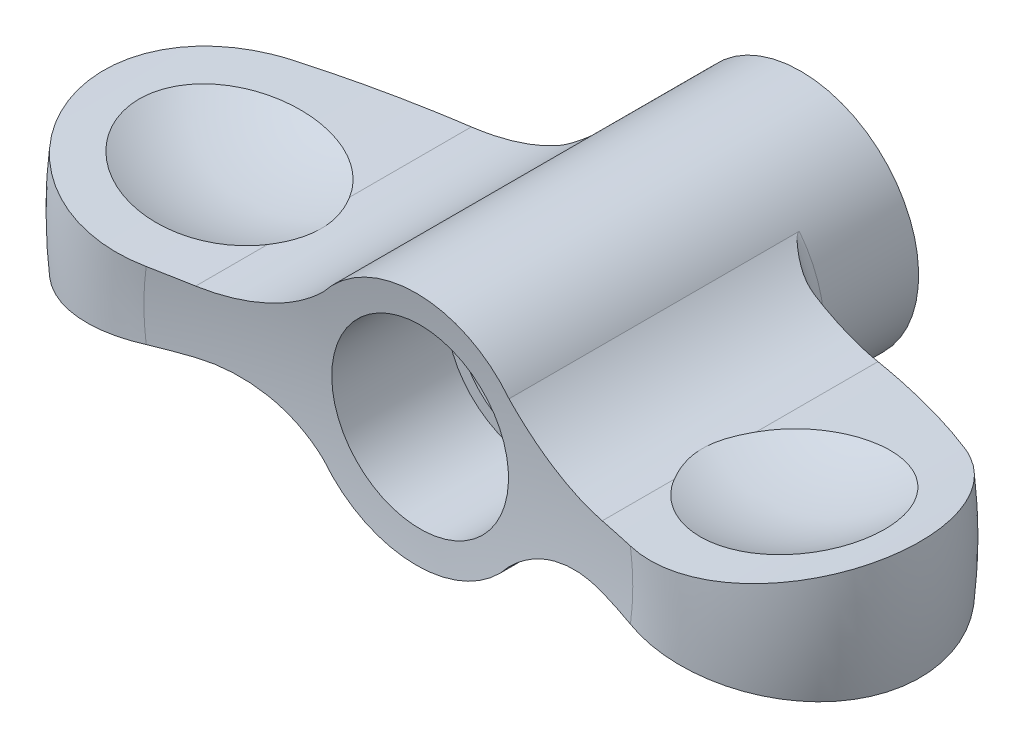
ISO-10303-21;
HEADER;
FILE_DESCRIPTION(('STEP AP214'),'2;1');
FILE_NAME('part.step','',(''),(''),'','','');
FILE_SCHEMA(('AUTOMOTIVE_DESIGN { 1 0 10303 214 1 1 1 1 }'));
ENDSEC;
DATA;
#1=APPLICATION_CONTEXT('core data for automotive mechanical design processes');
#2=APPLICATION_PROTOCOL_DEFINITION('international standard','automotive_design',2000,#1);
#3=PRODUCT_CONTEXT('',#1,'mechanical');
#4=PRODUCT('Part','Part','',(#3));
#5=PRODUCT_RELATED_PRODUCT_CATEGORY('part','',(#4));
#6=PRODUCT_DEFINITION_FORMATION('','',#4);
#7=PRODUCT_DEFINITION_CONTEXT('part definition',#1,'design');
#8=PRODUCT_DEFINITION('design','',#6,#7);
#9=PRODUCT_DEFINITION_SHAPE('','',#8);
#10=(LENGTH_UNIT() NAMED_UNIT(*) SI_UNIT(.MILLI.,.METRE.));
#11=(NAMED_UNIT(*) PLANE_ANGLE_UNIT() SI_UNIT($,.RADIAN.));
#12=(NAMED_UNIT(*) SI_UNIT($,.STERADIAN.) SOLID_ANGLE_UNIT());
#13=UNCERTAINTY_MEASURE_WITH_UNIT(LENGTH_MEASURE(1.E-05),#10,'distance_accuracy_value','');
#14=(GEOMETRIC_REPRESENTATION_CONTEXT(3) GLOBAL_UNCERTAINTY_ASSIGNED_CONTEXT((#13)) GLOBAL_UNIT_ASSIGNED_CONTEXT((#10,
#11,#12)) REPRESENTATION_CONTEXT('',''));
#15=CARTESIAN_POINT('',(0.,0.,0.));
#16=DIRECTION('',(0.,0.,1.));
#17=DIRECTION('',(1.,0.,0.));
#18=AXIS2_PLACEMENT_3D('',#15,#16,#17);
#19=CARTESIAN_POINT('',(0.,0.,8.));
#20=DIRECTION('',(0.,0.,-1.));
#21=DIRECTION('',(0.,1.,0.));
#22=AXIS2_PLACEMENT_3D('',#19,#20,#21);
#23=TOROIDAL_SURFACE('',#22,11.8,1.80000000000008);
#24=CARTESIAN_POINT('',(-10.9364004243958,-3.94636818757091,9.7916319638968));
#25=CARTESIAN_POINT('',(-10.8241185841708,-4.00370429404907,9.78325234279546));
#26=CARTESIAN_POINT('',(-10.7132133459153,-4.06254400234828,9.76897182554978));
#27=CARTESIAN_POINT('',(-10.4947965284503,-4.18269546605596,9.73031315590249));
#28=CARTESIAN_POINT('',(-10.3872790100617,-4.2440024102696,9.70595387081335));
#29=CARTESIAN_POINT('',(-10.1765147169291,-4.368381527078,9.64897611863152));
#30=CARTESIAN_POINT('',(-10.0732455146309,-4.43144032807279,9.61641003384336));
#31=CARTESIAN_POINT('',(-9.87034998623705,-4.55941800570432,9.54423053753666));
#32=CARTESIAN_POINT('',(-9.7707251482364,-4.62433762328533,9.50461428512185));
#33=CARTESIAN_POINT('',(-9.55076497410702,-4.77218804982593,9.4087986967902));
#34=CARTESIAN_POINT('',(-9.43146470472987,-4.8555710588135,9.35092807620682));
#35=CARTESIAN_POINT('',(-9.19845422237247,-5.02453572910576,9.22749490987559));
#36=CARTESIAN_POINT('',(-9.08474708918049,-5.11011856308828,9.16192819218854));
#37=CARTESIAN_POINT('',(-8.8958350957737,-5.25740071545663,9.04459290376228));
#38=CARTESIAN_POINT('',(-8.81922141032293,-5.31864764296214,8.99450670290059));
#39=CARTESIAN_POINT('',(-8.66877804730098,-5.44185241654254,8.89113944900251));
#40=CARTESIAN_POINT('',(-8.5949480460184,-5.50381017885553,8.83785876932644));
#41=CARTESIAN_POINT('',(-8.47417990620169,-5.60755853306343,8.74594898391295));
#42=CARTESIAN_POINT('',(-8.42641392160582,-5.64925103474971,8.7082931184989));
#43=CARTESIAN_POINT('',(-8.33242521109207,-5.73256077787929,8.63109723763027));
#44=CARTESIAN_POINT('',(-8.28620142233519,-5.77417805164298,8.59155856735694));
#45=CARTESIAN_POINT('',(-8.21125367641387,-5.8426693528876,8.52388347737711));
#46=CARTESIAN_POINT('',(-8.18198002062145,-5.86968993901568,8.49650386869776));
#47=CARTESIAN_POINT('',(-8.12444979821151,-5.92330159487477,8.44010631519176));
#48=CARTESIAN_POINT('',(-8.09619524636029,-5.94989176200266,8.41108538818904));
#49=CARTESIAN_POINT('',(-8.04234032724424,-6.00103726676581,8.35179046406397));
#50=CARTESIAN_POINT('',(-8.01668026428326,-6.02563150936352,8.32160361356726));
#51=CARTESIAN_POINT('',(-7.96790958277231,-6.0727602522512,8.2576023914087));
#52=CARTESIAN_POINT('',(-7.94479257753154,-6.0952998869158,8.22379754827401));
#53=CARTESIAN_POINT('',(-7.91701322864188,-6.12255630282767,8.17250880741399));
#54=CARTESIAN_POINT('',(-7.90975258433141,-6.12970126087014,8.15779331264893));
#55=CARTESIAN_POINT('',(-7.89665438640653,-6.14261741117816,8.12727584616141));
#56=CARTESIAN_POINT('',(-7.89080740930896,-6.14839769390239,8.11148202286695));
#57=CARTESIAN_POINT('',(-7.88158226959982,-6.15753000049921,8.08013275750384));
#58=CARTESIAN_POINT('',(-7.87802903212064,-6.16105398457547,8.06468423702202));
#59=CARTESIAN_POINT('',(-7.87307566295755,-6.16597001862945,8.03281428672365));
#60=CARTESIAN_POINT('',(-7.87172008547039,-6.16731795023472,8.01637956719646));
#61=CARTESIAN_POINT('',(-7.8717856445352,-6.16725149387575,7.9998));
#62=B_SPLINE_CURVE_WITH_KNOTS('',3,(#24,#25,#26,#27,#28,#29,#30,#31,#32,#33,#34,#35,#36,#37,#38,
#39,#40,#41,#42,#43,#44,#45,#46,#47,#48,#49,#50,#51,#52,#53,#54,#55,#56,#57,#58,#59,#60,#61),
.UNSPECIFIED.,.F.,.F.,(4,2,2,2,2,2,2,2,2,2,2,2,2,2,2,2,2,2,4),(0.,0.378686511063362,
0.756667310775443,1.13229407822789,1.50807255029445,1.97761636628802,2.44741590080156,
2.77774393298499,3.10803343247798,3.3292309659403,3.55027276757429,3.6952714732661,
3.84054267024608,3.980393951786,4.11988557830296,4.17347981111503,4.2267062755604,
4.27513325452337,4.3245302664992),.UNSPECIFIED.);
#63=CARTESIAN_POINT('',(-10.9337221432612,-3.94773654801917,9.7914319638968));
#64=VERTEX_POINT('',#63);
#65=CARTESIAN_POINT('',(-7.8717855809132,-6.16725155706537,8.));
#66=VERTEX_POINT('',#65);
#67=EDGE_CURVE('E491',#64,#66,#62,.T.);
#68=ORIENTED_EDGE('',*,*,#67,.F.);
#69=CARTESIAN_POINT('',(0.,0.,9.7914319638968));
#70=DIRECTION('',(0.,0.,-1.));
#71=DIRECTION('',(0.,1.,0.));
#72=AXIS2_PLACEMENT_3D('',#69,#70,#71);
#73=CIRCLE('',#72,11.6245818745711);
#74=CARTESIAN_POINT('',(-10.9337221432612,3.94773654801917,9.7914319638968));
#75=VERTEX_POINT('',#74);
#76=EDGE_CURVE('E513',#64,#75,#73,.T.);
#77=ORIENTED_EDGE('',*,*,#76,.T.);
#78=CARTESIAN_POINT('',(-10.9364004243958,3.94636818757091,9.7916319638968));
#79=CARTESIAN_POINT('',(-10.8241185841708,4.00370429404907,9.78325234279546));
#80=CARTESIAN_POINT('',(-10.7132133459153,4.06254400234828,9.76897182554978));
#81=CARTESIAN_POINT('',(-10.4947965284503,4.18269546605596,9.73031315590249));
#82=CARTESIAN_POINT('',(-10.3872790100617,4.24400241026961,9.70595387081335));
#83=CARTESIAN_POINT('',(-10.1765147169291,4.368381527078,9.64897611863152));
#84=CARTESIAN_POINT('',(-10.0732455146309,4.4314403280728,9.61641003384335));
#85=CARTESIAN_POINT('',(-9.87034998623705,4.55941800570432,9.54423053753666));
#86=CARTESIAN_POINT('',(-9.7707251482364,4.62433762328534,9.50461428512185));
#87=CARTESIAN_POINT('',(-9.55076497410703,4.77218804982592,9.4087986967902));
#88=CARTESIAN_POINT('',(-9.4314647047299,4.85557105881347,9.35092807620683));
#89=CARTESIAN_POINT('',(-9.19845422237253,5.02453572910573,9.22749490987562));
#90=CARTESIAN_POINT('',(-9.08474708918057,5.11011856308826,9.16192819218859));
#91=CARTESIAN_POINT('',(-8.89583509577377,5.25740071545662,9.04459290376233));
#92=CARTESIAN_POINT('',(-8.81922141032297,5.31864764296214,8.99450670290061));
#93=CARTESIAN_POINT('',(-8.66877804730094,5.44185241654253,8.89113944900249));
#94=CARTESIAN_POINT('',(-8.59494804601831,5.50381017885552,8.83785876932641));
#95=CARTESIAN_POINT('',(-8.47417990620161,5.60755853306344,8.74594898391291));
#96=CARTESIAN_POINT('',(-8.42641392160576,5.64925103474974,8.70829311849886));
#97=CARTESIAN_POINT('',(-8.33242521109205,5.73256077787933,8.63109723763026));
#98=CARTESIAN_POINT('',(-8.28620142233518,5.774178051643,8.59155856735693));
#99=CARTESIAN_POINT('',(-8.21125367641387,5.8426693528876,8.52388347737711));
#100=CARTESIAN_POINT('',(-8.18198002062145,5.86968993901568,8.49650386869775));
#101=CARTESIAN_POINT('',(-8.1244497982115,5.92330159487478,8.44010631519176));
#102=CARTESIAN_POINT('',(-8.09619524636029,5.94989176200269,8.41108538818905));
#103=CARTESIAN_POINT('',(-8.04234032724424,6.00103726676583,8.35179046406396));
#104=CARTESIAN_POINT('',(-8.01668026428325,6.02563150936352,8.32160361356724));
#105=CARTESIAN_POINT('',(-7.9679095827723,6.07276025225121,8.25760239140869));
#106=CARTESIAN_POINT('',(-7.94479257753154,6.09529988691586,8.22379754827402));
#107=CARTESIAN_POINT('',(-7.91701322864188,6.12255630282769,8.17250880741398));
#108=CARTESIAN_POINT('',(-7.90975258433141,6.12970126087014,8.15779331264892));
#109=CARTESIAN_POINT('',(-7.89665438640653,6.14261741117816,8.1272758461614));
#110=CARTESIAN_POINT('',(-7.89080740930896,6.14839769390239,8.11148202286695));
#111=CARTESIAN_POINT('',(-7.88158226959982,6.15753000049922,8.08013275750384));
#112=CARTESIAN_POINT('',(-7.87802903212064,6.16105398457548,8.06468423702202));
#113=CARTESIAN_POINT('',(-7.87307566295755,6.16597001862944,8.03281428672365));
#114=CARTESIAN_POINT('',(-7.8717200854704,6.16731795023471,8.01637956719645));
#115=CARTESIAN_POINT('',(-7.8717856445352,6.16725149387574,7.9998));
#116=B_SPLINE_CURVE_WITH_KNOTS('',3,(#78,#79,#80,#81,#82,#83,#84,#85,#86,#87,#88,#89,#90,#91,
#92,#93,#94,#95,#96,#97,#98,#99,#100,#101,#102,#103,#104,#105,#106,#107,#108,#109,#110,#111,
#112,#113,#114,#115),.UNSPECIFIED.,.F.,.F.,(4,2,2,2,2,2,2,2,2,2,2,2,2,2,2,2,2,2,4),(0.,
0.378686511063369,0.756667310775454,1.1322940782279,1.50807255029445,1.97761636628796,
2.44741590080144,2.77774393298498,3.10803343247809,3.32923096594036,3.55027276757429,
3.6952714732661,3.84054267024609,3.98039395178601,4.11988557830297,4.17347981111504,
4.22670627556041,4.27513325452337,4.3245302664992),.UNSPECIFIED.);
#117=CARTESIAN_POINT('',(-7.8717855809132,6.16725155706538,8.));
#118=VERTEX_POINT('',#117);
#119=EDGE_CURVE('E318',#75,#118,#116,.T.);
#120=ORIENTED_EDGE('',*,*,#119,.T.);
#121=CARTESIAN_POINT('',(0.,0.,8.));
#122=DIRECTION('',(0.,0.,-1.));
#123=DIRECTION('',(0.,1.,0.));
#124=AXIS2_PLACEMENT_3D('',#121,#122,#123);
#125=CIRCLE('',#124,10.);
#126=EDGE_CURVE('E438',#66,#118,#125,.T.);
#127=ORIENTED_EDGE('',*,*,#126,.F.);
#128=EDGE_LOOP('',(#68,#77,#120,#127));
#129=FACE_BOUND('',#128,.T.);
#130=ADVANCED_FACE('F14',(#129),#23,.F.);
#131=CARTESIAN_POINT('',(0.,0.,60.3122983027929));
#132=DIRECTION('',(0.,0.,-1.));
#133=DIRECTION('',(0.,1.,0.));
#134=AXIS2_PLACEMENT_3D('',#131,#132,#133);
#135=DEGENERATE_TOROIDAL_SURFACE('',#134,6.6775474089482,50.7624968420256,.T.);
#136=ORIENTED_EDGE('',*,*,#76,.F.);
#137=CARTESIAN_POINT('',(-6.5467060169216,-7.72330133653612,9.66697769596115));
#138=CARTESIAN_POINT('',(-6.64591288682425,-7.58492422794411,9.66416255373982));
#139=CARTESIAN_POINT('',(-6.74799440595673,-7.44862247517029,9.661900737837));
#140=CARTESIAN_POINT('',(-6.95774811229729,-7.18037757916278,9.65844214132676));
#141=CARTESIAN_POINT('',(-7.06542027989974,-7.04843442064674,9.6572453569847));
#142=CARTESIAN_POINT('',(-7.39653737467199,-6.6595102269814,9.65519040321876));
#143=CARTESIAN_POINT('',(-7.62812663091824,-6.40937348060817,9.65586643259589));
#144=CARTESIAN_POINT('',(-8.11129299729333,-5.92925394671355,9.66138002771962));
#145=CARTESIAN_POINT('',(-8.36287299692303,-5.69927408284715,9.66621819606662));
#146=CARTESIAN_POINT('',(-8.88421895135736,-5.26109545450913,9.68055080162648));
#147=CARTESIAN_POINT('',(-9.15398440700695,-5.05289609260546,9.69004511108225));
#148=CARTESIAN_POINT('',(-9.70731186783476,-4.66146851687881,9.71434109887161));
#149=CARTESIAN_POINT('',(-9.99073342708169,-4.47803881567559,9.72909588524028));
#150=CARTESIAN_POINT('',(-10.5714417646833,-4.13530031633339,9.76473262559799));
#151=CARTESIAN_POINT('',(-10.8687285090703,-3.97599145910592,9.78561456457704));
#152=CARTESIAN_POINT('',(-11.4746831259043,-3.68269992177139,9.83420440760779));
#153=CARTESIAN_POINT('',(-11.7833407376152,-3.54869504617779,9.86190627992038));
#154=CARTESIAN_POINT('',(-12.4099583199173,-3.30668939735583,9.92468529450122));
#155=CARTESIAN_POINT('',(-12.72791823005,-3.19868845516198,9.95976238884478));
#156=CARTESIAN_POINT('',(-13.3702784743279,-3.00943594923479,10.0375625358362));
#157=CARTESIAN_POINT('',(-13.694668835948,-2.92814595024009,10.080274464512));
#158=CARTESIAN_POINT('',(-14.3479208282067,-2.7924555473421,10.173495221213));
#159=CARTESIAN_POINT('',(-14.6767824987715,-2.73805538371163,10.2240041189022));
#160=CARTESIAN_POINT('',(-15.3369192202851,-2.65620760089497,10.3328061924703));
#161=CARTESIAN_POINT('',(-15.6681964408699,-2.62878831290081,10.3911074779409));
#162=CARTESIAN_POINT('',(-16.3304789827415,-2.60086726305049,10.5152293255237));
#163=CARTESIAN_POINT('',(-16.6614842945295,-2.60036640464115,10.5810501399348));
#164=CARTESIAN_POINT('',(-17.3240428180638,-2.62605289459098,10.7205107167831));
#165=CARTESIAN_POINT('',(-17.6555720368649,-2.65249066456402,10.7942180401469));
#166=CARTESIAN_POINT('',(-18.3138495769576,-2.73187573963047,10.9484805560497));
#167=CARTESIAN_POINT('',(-18.6405974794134,-2.78482535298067,11.0290363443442));
#168=CARTESIAN_POINT('',(-19.2867879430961,-2.91642655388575,11.1963521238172));
#169=CARTESIAN_POINT('',(-19.6062391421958,-2.99504586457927,11.2831042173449));
#170=CARTESIAN_POINT('',(-20.2362844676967,-3.17708996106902,11.4622866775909));
#171=CARTESIAN_POINT('',(-20.5468805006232,-3.28050936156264,11.5547158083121));
#172=CARTESIAN_POINT('',(-20.8521318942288,-3.39588894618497,11.6496949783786));
#173=B_SPLINE_CURVE_WITH_KNOTS('',3,(#137,#138,#139,#140,#141,#142,#143,#144,#145,#146,#147,
#148,#149,#150,#151,#152,#153,#154,#155,#156,#157,#158,#159,#160,#161,#162,#163,#164,#165,#166,
#167,#168,#169,#170,#171,#172),.UNSPECIFIED.,.F.,.F.,(4,2,2,2,2,2,2,2,2,2,2,2,2,2,2,2,2,4),(0.,
0.510785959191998,1.02157012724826,2.04291399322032,3.06440575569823,4.08586949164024,
5.09844663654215,6.11102130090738,7.12270361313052,8.13437935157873,9.14459291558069,
10.1548155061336,11.1660977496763,12.1774139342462,13.1982178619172,14.2191106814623,
15.2387247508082,16.2581176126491),.UNSPECIFIED.);
#174=CARTESIAN_POINT('',(-17.2513916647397,-2.62600423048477,10.7060191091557));
#175=VERTEX_POINT('',#174);
#176=EDGE_CURVE('E485',#64,#175,#173,.T.);
#177=ORIENTED_EDGE('',*,*,#176,.T.);
#178=CARTESIAN_POINT('',(-28.5420587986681,-3.86093353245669,14.6248916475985));
#179=CARTESIAN_POINT('',(-28.0949251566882,-3.78973654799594,14.4056959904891));
#180=CARTESIAN_POINT('',(-27.6441940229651,-3.72065339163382,14.1932196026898));
#181=CARTESIAN_POINT('',(-26.7359054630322,-3.58698745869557,13.7818878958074));
#182=CARTESIAN_POINT('',(-26.2783480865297,-3.52240464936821,13.583032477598));
#183=CARTESIAN_POINT('',(-24.8998297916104,-3.33633398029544,13.0087706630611));
#184=CARTESIAN_POINT('',(-23.9692804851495,-3.22192463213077,12.6538347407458));
#185=CARTESIAN_POINT('',(-22.0863023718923,-3.01405683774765,12.0002442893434));
#186=CARTESIAN_POINT('',(-21.133873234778,-2.92059870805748,11.701590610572));
#187=CARTESIAN_POINT('',(-19.6898454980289,-2.79722984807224,11.296179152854));
#188=CARTESIAN_POINT('',(-19.2049108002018,-2.75884755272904,11.1679139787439));
#189=CARTESIAN_POINT('',(-18.2309836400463,-2.68796520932,10.9259763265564));
#190=CARTESIAN_POINT('',(-17.7419911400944,-2.65546521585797,10.8123039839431));
#191=CARTESIAN_POINT('',(-17.2511916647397,-2.6259922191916,10.7059757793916));
#192=B_SPLINE_CURVE_WITH_KNOTS('',3,(#178,#179,#180,#181,#182,#183,#184,#185,#186,#187,#188,
#189,#190,#191),.UNSPECIFIED.,.F.,.F.,(4,2,2,2,2,2,4),(0.,1.50898291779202,3.01795485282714,
6.0232908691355,9.02867228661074,10.5376740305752,12.0466897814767),.UNSPECIFIED.);
#193=CARTESIAN_POINT('',(-28.5416508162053,-3.86086857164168,14.6246916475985));
#194=VERTEX_POINT('',#193);
#195=EDGE_CURVE('E524',#194,#175,#192,.T.);
#196=ORIENTED_EDGE('',*,*,#195,.F.);
#197=CARTESIAN_POINT('',(0.,0.,14.6246916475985));
#198=DIRECTION('',(0.,0.,-1.));
#199=DIRECTION('',(0.,1.,0.));
#200=AXIS2_PLACEMENT_3D('',#197,#198,#199);
#201=CIRCLE('',#200,28.8015995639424);
#202=CARTESIAN_POINT('',(-28.5416508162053,3.86086857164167,14.6246916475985));
#203=VERTEX_POINT('',#202);
#204=EDGE_CURVE('E511',#194,#203,#201,.T.);
#205=ORIENTED_EDGE('',*,*,#204,.T.);
#206=CARTESIAN_POINT('',(-28.5420587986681,3.86093353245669,14.6248916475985));
#207=CARTESIAN_POINT('',(-28.0949251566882,3.78973654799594,14.4056959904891));
#208=CARTESIAN_POINT('',(-27.6441940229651,3.72065339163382,14.1932196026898));
#209=CARTESIAN_POINT('',(-26.7359054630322,3.58698745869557,13.7818878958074));
#210=CARTESIAN_POINT('',(-26.2783480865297,3.5224046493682,13.583032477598));
#211=CARTESIAN_POINT('',(-24.8998297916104,3.33633398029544,13.0087706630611));
#212=CARTESIAN_POINT('',(-23.9692804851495,3.22192463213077,12.6538347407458));
#213=CARTESIAN_POINT('',(-22.0863023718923,3.01405683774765,12.0002442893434));
#214=CARTESIAN_POINT('',(-21.133873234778,2.92059870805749,11.701590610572));
#215=CARTESIAN_POINT('',(-19.6898454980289,2.79722984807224,11.296179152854));
#216=CARTESIAN_POINT('',(-19.2049108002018,2.75884755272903,11.1679139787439));
#217=CARTESIAN_POINT('',(-18.2309836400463,2.68796520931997,10.9259763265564));
#218=CARTESIAN_POINT('',(-17.7419911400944,2.65546521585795,10.8123039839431));
#219=CARTESIAN_POINT('',(-17.2511916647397,2.62599221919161,10.7059757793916));
#220=B_SPLINE_CURVE_WITH_KNOTS('',3,(#206,#207,#208,#209,#210,#211,#212,#213,#214,#215,#216,
#217,#218,#219),.UNSPECIFIED.,.F.,.F.,(4,2,2,2,2,2,4),(0.,1.50898291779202,3.01795485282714,
6.0232908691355,9.02867228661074,10.5376740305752,12.0466897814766),.UNSPECIFIED.);
#221=CARTESIAN_POINT('',(-17.2513916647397,2.62600423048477,10.7060191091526));
#222=VERTEX_POINT('',#221);
#223=EDGE_CURVE('E332',#203,#222,#220,.T.);
#224=ORIENTED_EDGE('',*,*,#223,.T.);
#225=CARTESIAN_POINT('',(-6.5467060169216,7.72330133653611,9.66697769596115));
#226=CARTESIAN_POINT('',(-6.64591288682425,7.5849242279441,9.66416255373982));
#227=CARTESIAN_POINT('',(-6.74799440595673,7.44862247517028,9.661900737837));
#228=CARTESIAN_POINT('',(-6.9577481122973,7.18037757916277,9.65844214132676));
#229=CARTESIAN_POINT('',(-7.06542027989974,7.04843442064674,9.6572453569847));
#230=CARTESIAN_POINT('',(-7.39653737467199,6.65951022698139,9.65519040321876));
#231=CARTESIAN_POINT('',(-7.62812663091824,6.40937348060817,9.65586643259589));
#232=CARTESIAN_POINT('',(-8.11129299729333,5.92925394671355,9.66138002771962));
#233=CARTESIAN_POINT('',(-8.36287299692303,5.69927408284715,9.66621819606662));
#234=CARTESIAN_POINT('',(-8.88421895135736,5.26109545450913,9.68055080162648));
#235=CARTESIAN_POINT('',(-9.15398440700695,5.05289609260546,9.69004511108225));
#236=CARTESIAN_POINT('',(-9.70731186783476,4.66146851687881,9.71434109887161));
#237=CARTESIAN_POINT('',(-9.99073342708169,4.47803881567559,9.72909588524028));
#238=CARTESIAN_POINT('',(-10.5714417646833,4.13530031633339,9.76473262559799));
#239=CARTESIAN_POINT('',(-10.8687285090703,3.97599145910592,9.78561456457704));
#240=CARTESIAN_POINT('',(-11.4746831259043,3.68269992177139,9.83420440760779));
#241=CARTESIAN_POINT('',(-11.7833407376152,3.54869504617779,9.86190627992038));
#242=CARTESIAN_POINT('',(-12.4099583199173,3.30668939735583,9.92468529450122));
#243=CARTESIAN_POINT('',(-12.72791823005,3.19868845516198,9.95976238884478));
#244=CARTESIAN_POINT('',(-13.3702784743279,3.00943594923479,10.0375625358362));
#245=CARTESIAN_POINT('',(-13.694668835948,2.92814595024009,10.080274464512));
#246=CARTESIAN_POINT('',(-14.3479208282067,2.7924555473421,10.173495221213));
#247=CARTESIAN_POINT('',(-14.6767824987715,2.73805538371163,10.2240041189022));
#248=CARTESIAN_POINT('',(-15.3369192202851,2.65620760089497,10.3328061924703));
#249=CARTESIAN_POINT('',(-15.6681964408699,2.62878831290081,10.3911074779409));
#250=CARTESIAN_POINT('',(-16.3304789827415,2.60086726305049,10.5152293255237));
#251=CARTESIAN_POINT('',(-16.6614842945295,2.60036640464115,10.5810501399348));
#252=CARTESIAN_POINT('',(-17.3240428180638,2.62605289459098,10.7205107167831));
#253=CARTESIAN_POINT('',(-17.6555720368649,2.65249066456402,10.7942180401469));
#254=CARTESIAN_POINT('',(-18.3138495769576,2.73187573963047,10.9484805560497));
#255=CARTESIAN_POINT('',(-18.6405974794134,2.78482535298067,11.0290363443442));
#256=CARTESIAN_POINT('',(-19.2867879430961,2.91642655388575,11.1963521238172));
#257=CARTESIAN_POINT('',(-19.6062391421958,2.99504586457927,11.2831042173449));
#258=CARTESIAN_POINT('',(-20.2362844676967,3.17708996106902,11.4622866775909));
#259=CARTESIAN_POINT('',(-20.5468805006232,3.28050936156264,11.5547158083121));
#260=CARTESIAN_POINT('',(-20.8521318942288,3.39588894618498,11.6496949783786));
#261=B_SPLINE_CURVE_WITH_KNOTS('',3,(#225,#226,#227,#228,#229,#230,#231,#232,#233,#234,#235,
#236,#237,#238,#239,#240,#241,#242,#243,#244,#245,#246,#247,#248,#249,#250,#251,#252,#253,#254,
#255,#256,#257,#258,#259,#260),.UNSPECIFIED.,.F.,.F.,(4,2,2,2,2,2,2,2,2,2,2,2,2,2,2,2,2,4),(0.,
0.510785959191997,1.02157012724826,2.04291399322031,3.06440575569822,4.08586949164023,
5.09844663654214,6.11102130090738,7.12270361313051,8.13437935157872,9.14459291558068,
10.1548155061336,11.1660977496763,12.1774139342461,13.1982178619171,14.2191106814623,
15.2387247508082,16.2581176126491),.UNSPECIFIED.);
#262=EDGE_CURVE('E301',#75,#222,#261,.T.);
#263=ORIENTED_EDGE('',*,*,#262,.F.);
#264=EDGE_LOOP('',(#136,#177,#196,#205,#224,#263));
#265=FACE_BOUND('',#264,.T.);
#266=ADVANCED_FACE('F521',(#265),#135,.T.);
#267=CARTESIAN_POINT('',(0.,0.,24.5131504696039));
#268=DIRECTION('',(0.,0.,-1.));
#269=DIRECTION('',(0.,1.,0.));
#270=AXIS2_PLACEMENT_3D('',#267,#268,#269);
#271=TOROIDAL_SURFACE('',#270,24.0131504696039,10.9868495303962);
#272=CARTESIAN_POINT('',(-17.2511916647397,-2.62599221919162,33.3242100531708));
#273=CARTESIAN_POINT('',(-17.4993781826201,-2.64089075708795,33.5086851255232));
#274=CARTESIAN_POINT('',(-17.7552628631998,-2.65706460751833,33.6826969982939));
#275=CARTESIAN_POINT('',(-18.28053769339,-2.69210530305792,34.0086627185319));
#276=CARTESIAN_POINT('',(-18.5499277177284,-2.71097212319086,34.1606167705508));
#277=CARTESIAN_POINT('',(-19.1002002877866,-2.75153205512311,34.4412740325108));
#278=CARTESIAN_POINT('',(-19.381077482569,-2.77322386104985,34.5699879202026));
#279=CARTESIAN_POINT('',(-19.952432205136,-2.81952002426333,34.8033129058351));
#280=CARTESIAN_POINT('',(-20.2429095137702,-2.84412431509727,34.9079245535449));
#281=CARTESIAN_POINT('',(-20.8315983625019,-2.89628797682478,35.0923323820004));
#282=CARTESIAN_POINT('',(-21.1298150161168,-2.92384934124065,35.1721116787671));
#283=CARTESIAN_POINT('',(-21.7316508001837,-2.98187199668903,35.3061577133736));
#284=CARTESIAN_POINT('',(-22.035269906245,-3.01233327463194,35.3604245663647));
#285=CARTESIAN_POINT('',(-22.6456357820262,-3.0760359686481,35.4430189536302));
#286=CARTESIAN_POINT('',(-22.9523815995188,-3.10927655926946,35.4713541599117));
#287=CARTESIAN_POINT('',(-23.566877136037,-3.17836345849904,35.501889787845));
#288=CARTESIAN_POINT('',(-23.874626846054,-3.21420974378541,35.504090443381));
#289=CARTESIAN_POINT('',(-24.4874432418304,-3.28807700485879,35.4823817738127));
#290=CARTESIAN_POINT('',(-24.7925157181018,-3.32608674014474,35.4585974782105));
#291=CARTESIAN_POINT('',(-25.3992908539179,-3.404117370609,35.3852808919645));
#292=CARTESIAN_POINT('',(-25.7009935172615,-3.44413826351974,35.3357486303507));
#293=CARTESIAN_POINT('',(-26.2989412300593,-3.52581537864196,35.211278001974));
#294=CARTESIAN_POINT('',(-26.595185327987,-3.56747188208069,35.1363352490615));
#295=CARTESIAN_POINT('',(-27.1800717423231,-3.65197221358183,34.9615826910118));
#296=CARTESIAN_POINT('',(-27.4687140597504,-3.69481604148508,34.8617728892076));
#297=CARTESIAN_POINT('',(-28.035952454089,-3.78113479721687,34.6381665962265));
#298=CARTESIAN_POINT('',(-28.3145627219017,-3.82460870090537,34.514405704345));
#299=CARTESIAN_POINT('',(-28.8602471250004,-3.9117173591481,34.2436848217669));
#300=CARTESIAN_POINT('',(-29.1273212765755,-3.9553521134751,34.0967248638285));
#301=CARTESIAN_POINT('',(-29.6480727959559,-4.04221651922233,33.7806574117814));
#302=CARTESIAN_POINT('',(-29.9017509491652,-4.08544619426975,33.6115512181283));
#303=CARTESIAN_POINT('',(-30.3939845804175,-4.17091924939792,33.2523788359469));
#304=CARTESIAN_POINT('',(-30.6325400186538,-4.21316262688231,33.0623125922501));
#305=CARTESIAN_POINT('',(-31.0935716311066,-4.29619199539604,32.6619711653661));
#306=CARTESIAN_POINT('',(-31.3159985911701,-4.33697334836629,32.4516383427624));
#307=CARTESIAN_POINT('',(-31.7424740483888,-4.41635307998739,32.0127202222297));
#308=CARTESIAN_POINT('',(-31.9465225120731,-4.45495145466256,31.7841348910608));
#309=CARTESIAN_POINT('',(-32.3348520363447,-4.52938773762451,31.3103146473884));
#310=CARTESIAN_POINT('',(-32.5191323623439,-4.56522554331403,31.0650791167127));
#311=CARTESIAN_POINT('',(-32.8666572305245,-4.63358841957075,30.5596945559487));
#312=CARTESIAN_POINT('',(-33.0299017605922,-4.66611348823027,30.2995455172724));
#313=CARTESIAN_POINT('',(-33.3345075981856,-4.72739462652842,29.7656976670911));
#314=CARTESIAN_POINT('',(-33.4758297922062,-4.75614394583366,29.4919757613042));
#315=CARTESIAN_POINT('',(-33.7352733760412,-4.80934524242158,28.9333467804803));
#316=CARTESIAN_POINT('',(-33.8533947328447,-4.83379721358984,28.6484396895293));
#317=CARTESIAN_POINT('',(-34.0656204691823,-4.87800530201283,28.0694731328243));
#318=CARTESIAN_POINT('',(-34.1597255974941,-4.89776156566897,27.7754139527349));
#319=CARTESIAN_POINT('',(-34.3232748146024,-4.93225390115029,27.180228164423));
#320=CARTESIAN_POINT('',(-34.3927189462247,-4.94698998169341,26.8791015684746));
#321=CARTESIAN_POINT('',(-34.5063857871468,-4.97117989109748,26.2723608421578));
#322=CARTESIAN_POINT('',(-34.5506442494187,-4.98064120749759,25.96675370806));
#323=CARTESIAN_POINT('',(-34.6137870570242,-4.99415603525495,25.3528106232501));
#324=CARTESIAN_POINT('',(-34.6326714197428,-4.99820955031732,25.0444746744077));
#325=CARTESIAN_POINT('',(-34.644935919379,-5.00084099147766,24.4272603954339));
#326=CARTESIAN_POINT('',(-34.6383150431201,-4.99941870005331,24.1183820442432));
#327=CARTESIAN_POINT('',(-34.5996125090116,-4.9911218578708,23.5022985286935));
#328=CARTESIAN_POINT('',(-34.5675308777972,-4.98424731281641,23.1950933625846));
#329=CARTESIAN_POINT('',(-34.4781950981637,-4.96517513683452,22.5850017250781));
#330=CARTESIAN_POINT('',(-34.4209785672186,-4.95298546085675,22.2821094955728));
#331=CARTESIAN_POINT('',(-34.2817747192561,-4.92348679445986,21.6823260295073));
#332=CARTESIAN_POINT('',(-34.1997873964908,-4.90617780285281,21.3854347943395));
#333=CARTESIAN_POINT('',(-34.0116119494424,-4.86672680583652,20.799780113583));
#334=CARTESIAN_POINT('',(-33.9054257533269,-4.84458518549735,20.5110160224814));
#335=CARTESIAN_POINT('',(-33.6695763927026,-4.79582854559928,19.9436331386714));
#336=CARTESIAN_POINT('',(-33.5399133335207,-4.76921354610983,19.665014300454));
#337=CARTESIAN_POINT('',(-33.2578321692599,-4.71190410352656,19.1195687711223));
#338=CARTESIAN_POINT('',(-33.1053878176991,-4.68120495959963,18.8527561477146));
#339=CARTESIAN_POINT('',(-32.7788934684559,-4.61623623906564,18.3331441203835));
#340=CARTESIAN_POINT('',(-32.6048429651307,-4.58196657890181,18.0803450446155));
#341=CARTESIAN_POINT('',(-32.2363296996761,-4.5103897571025,17.5905487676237));
#342=CARTESIAN_POINT('',(-32.0418667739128,-4.47308257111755,17.3535516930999));
#343=CARTESIAN_POINT('',(-31.633867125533,-4.39599896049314,16.8970435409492));
#344=CARTESIAN_POINT('',(-31.4203320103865,-4.35622274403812,16.6775309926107));
#345=CARTESIAN_POINT('',(-31.0011481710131,-4.27945832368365,16.2816097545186));
#346=CARTESIAN_POINT('',(-30.797399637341,-4.24267293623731,16.103144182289));
#347=CARTESIAN_POINT('',(-30.377205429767,-4.16804353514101,15.7621159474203));
#348=CARTESIAN_POINT('',(-30.1607608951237,-4.13019961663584,15.5995518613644));
#349=CARTESIAN_POINT('',(-29.7163820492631,-4.05387450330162,15.2912603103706));
#350=CARTESIAN_POINT('',(-29.4884504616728,-4.01539346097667,15.1455288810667));
#351=CARTESIAN_POINT('',(-29.0222683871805,-3.93818298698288,14.871631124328));
#352=CARTESIAN_POINT('',(-28.7840165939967,-3.89945352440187,14.7434670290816));
#353=CARTESIAN_POINT('',(-28.5412428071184,-3.86080360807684,14.6244916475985));
#354=B_SPLINE_CURVE_WITH_KNOTS('',3,(#272,#273,#274,#275,#276,#277,#278,#279,#280,#281,#282,
#283,#284,#285,#286,#287,#288,#289,#290,#291,#292,#293,#294,#295,#296,#297,#298,#299,#300,#301,
#302,#303,#304,#305,#306,#307,#308,#309,#310,#311,#312,#313,#314,#315,#316,#317,#318,#319,#320,
#321,#322,#323,#324,#325,#326,#327,#328,#329,#330,#331,#332,#333,#334,#335,#336,#337,#338,#339,
#340,#341,#342,#343,#344,#345,#346,#347,#348,#349,#350,#351,#352,#353),.UNSPECIFIED.,.F.,.F.,(4,
2,2,2,2,2,2,2,2,2,2,2,2,2,2,2,2,2,2,2,2,2,2,2,2,2,2,2,2,2,2,2,2,2,2,2,2,2,2,2,4),(0.,
0.928513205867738,1.85701780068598,2.7850947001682,3.7131504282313,4.64183578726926,
5.57051695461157,6.49892327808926,7.42732129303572,8.35127181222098,9.27522128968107,
10.1993303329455,11.1234392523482,12.0461850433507,12.9689295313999,13.8916198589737,
14.8143126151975,15.7397117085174,16.6651124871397,17.5905476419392,18.5159833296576,
19.4430516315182,20.3701212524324,21.2971619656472,22.2242010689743,23.1499208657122,
24.0756400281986,25.0013959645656,25.9271509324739,26.8515250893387,27.7758994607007,
28.7002002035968,29.6244967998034,30.5498666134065,31.4752580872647,32.4006569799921,
33.3259779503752,34.1452666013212,34.9644818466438,35.7835037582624,36.6026296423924),.UNSPECIFIED.);
#355=CARTESIAN_POINT('',(-20.5453214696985,-2.87092129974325,35.0026521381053));
#356=VERTEX_POINT('',#355);
#357=EDGE_CURVE('E527',#356,#194,#354,.T.);
#358=ORIENTED_EDGE('',*,*,#357,.F.);
#359=CARTESIAN_POINT('',(0.,0.,35.0026521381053));
#360=DIRECTION('',(0.,0.,-1.));
#361=DIRECTION('',(0.,1.,0.));
#362=AXIS2_PLACEMENT_3D('',#359,#360,#361);
#363=CIRCLE('',#362,20.7449372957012);
#364=CARTESIAN_POINT('',(-20.5453214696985,2.87092129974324,35.0026521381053));
#365=VERTEX_POINT('',#364);
#366=EDGE_CURVE('E509',#356,#365,#363,.T.);
#367=ORIENTED_EDGE('',*,*,#366,.T.);
#368=CARTESIAN_POINT('',(-17.2511916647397,2.6259922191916,33.3242100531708));
#369=CARTESIAN_POINT('',(-17.4993781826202,2.64089075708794,33.5086851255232));
#370=CARTESIAN_POINT('',(-17.7552628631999,2.65706460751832,33.6826969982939));
#371=CARTESIAN_POINT('',(-18.28053769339,2.69210530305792,34.0086627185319));
#372=CARTESIAN_POINT('',(-18.5499277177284,2.71097212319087,34.1606167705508));
#373=CARTESIAN_POINT('',(-19.1002002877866,2.75153205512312,34.4412740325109));
#374=CARTESIAN_POINT('',(-19.3810774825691,2.77322386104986,34.5699879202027));
#375=CARTESIAN_POINT('',(-19.952432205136,2.81952002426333,34.8033129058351));
#376=CARTESIAN_POINT('',(-20.2429095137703,2.84412431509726,34.9079245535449));
#377=CARTESIAN_POINT('',(-20.831598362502,2.89628797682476,35.0923323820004));
#378=CARTESIAN_POINT('',(-21.1298150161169,2.92384934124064,35.1721116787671));
#379=CARTESIAN_POINT('',(-21.7316508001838,2.98187199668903,35.3061577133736));
#380=CARTESIAN_POINT('',(-22.0352699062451,3.01233327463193,35.3604245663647));
#381=CARTESIAN_POINT('',(-22.6456357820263,3.0760359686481,35.4430189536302));
#382=CARTESIAN_POINT('',(-22.9523815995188,3.10927655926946,35.4713541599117));
#383=CARTESIAN_POINT('',(-23.566877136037,3.17836345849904,35.501889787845));
#384=CARTESIAN_POINT('',(-23.874626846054,3.21420974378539,35.504090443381));
#385=CARTESIAN_POINT('',(-24.4874432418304,3.28807700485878,35.4823817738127));
#386=CARTESIAN_POINT('',(-24.7925157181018,3.32608674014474,35.4585974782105));
#387=CARTESIAN_POINT('',(-25.3992908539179,3.40411737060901,35.3852808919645));
#388=CARTESIAN_POINT('',(-25.7009935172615,3.44413826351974,35.3357486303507));
#389=CARTESIAN_POINT('',(-26.2989412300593,3.52581537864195,35.211278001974));
#390=CARTESIAN_POINT('',(-26.595185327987,3.56747188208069,35.1363352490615));
#391=CARTESIAN_POINT('',(-27.1800717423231,3.65197221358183,34.9615826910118));
#392=CARTESIAN_POINT('',(-27.4687140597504,3.69481604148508,34.8617728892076));
#393=CARTESIAN_POINT('',(-28.035952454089,3.78113479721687,34.6381665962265));
#394=CARTESIAN_POINT('',(-28.3145627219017,3.82460870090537,34.514405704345));
#395=CARTESIAN_POINT('',(-28.8602471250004,3.9117173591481,34.2436848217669));
#396=CARTESIAN_POINT('',(-29.1273212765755,3.9553521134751,34.0967248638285));
#397=CARTESIAN_POINT('',(-29.6480727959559,4.04221651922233,33.7806574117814));
#398=CARTESIAN_POINT('',(-29.9017509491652,4.08544619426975,33.6115512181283));
#399=CARTESIAN_POINT('',(-30.3939845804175,4.17091924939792,33.2523788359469));
#400=CARTESIAN_POINT('',(-30.6325400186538,4.21316262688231,33.0623125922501));
#401=CARTESIAN_POINT('',(-31.0935716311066,4.29619199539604,32.6619711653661));
#402=CARTESIAN_POINT('',(-31.3159985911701,4.33697334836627,32.4516383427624));
#403=CARTESIAN_POINT('',(-31.7424740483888,4.41635307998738,32.0127202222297));
#404=CARTESIAN_POINT('',(-31.9465225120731,4.45495145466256,31.7841348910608));
#405=CARTESIAN_POINT('',(-32.3348520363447,4.52938773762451,31.3103146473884));
#406=CARTESIAN_POINT('',(-32.5191323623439,4.56522554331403,31.0650791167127));
#407=CARTESIAN_POINT('',(-32.8666572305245,4.63358841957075,30.5596945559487));
#408=CARTESIAN_POINT('',(-33.0299017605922,4.66611348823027,30.2995455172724));
#409=CARTESIAN_POINT('',(-33.3345075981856,4.72739462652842,29.7656976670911));
#410=CARTESIAN_POINT('',(-33.4758297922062,4.75614394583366,29.4919757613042));
#411=CARTESIAN_POINT('',(-33.7352733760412,4.80934524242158,28.9333467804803));
#412=CARTESIAN_POINT('',(-33.8533947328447,4.83379721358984,28.6484396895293));
#413=CARTESIAN_POINT('',(-34.0656204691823,4.87800530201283,28.0694731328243));
#414=CARTESIAN_POINT('',(-34.1597255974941,4.89776156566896,27.7754139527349));
#415=CARTESIAN_POINT('',(-34.3232748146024,4.93225390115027,27.180228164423));
#416=CARTESIAN_POINT('',(-34.3927189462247,4.94698998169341,26.8791015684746));
#417=CARTESIAN_POINT('',(-34.5063857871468,4.97117989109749,26.2723608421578));
#418=CARTESIAN_POINT('',(-34.5506442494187,4.98064120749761,25.96675370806));
#419=CARTESIAN_POINT('',(-34.6137870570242,4.99415603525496,25.3528106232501));
#420=CARTESIAN_POINT('',(-34.6326714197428,4.99820955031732,25.0444746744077));
#421=CARTESIAN_POINT('',(-34.644935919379,5.00084099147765,24.4272603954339));
#422=CARTESIAN_POINT('',(-34.6383150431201,4.9994187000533,24.1183820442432));
#423=CARTESIAN_POINT('',(-34.5996125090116,4.99112185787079,23.5022985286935));
#424=CARTESIAN_POINT('',(-34.5675308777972,4.98424731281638,23.1950933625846));
#425=CARTESIAN_POINT('',(-34.4781950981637,4.9651751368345,22.5850017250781));
#426=CARTESIAN_POINT('',(-34.4209785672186,4.95298546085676,22.2821094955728));
#427=CARTESIAN_POINT('',(-34.2817747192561,4.92348679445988,21.6823260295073));
#428=CARTESIAN_POINT('',(-34.1997873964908,4.90617780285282,21.3854347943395));
#429=CARTESIAN_POINT('',(-34.0116119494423,4.86672680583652,20.7997801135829));
#430=CARTESIAN_POINT('',(-33.9054257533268,4.84458518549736,20.5110160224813));
#431=CARTESIAN_POINT('',(-33.6695763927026,4.79582854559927,19.9436331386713));
#432=CARTESIAN_POINT('',(-33.5399133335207,4.76921354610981,19.6650143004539));
#433=CARTESIAN_POINT('',(-33.2578321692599,4.71190410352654,19.1195687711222));
#434=CARTESIAN_POINT('',(-33.1053878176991,4.68120495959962,18.8527561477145));
#435=CARTESIAN_POINT('',(-32.7788934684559,4.61623623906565,18.3331441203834));
#436=CARTESIAN_POINT('',(-32.6048429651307,4.58196657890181,18.0803450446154));
#437=CARTESIAN_POINT('',(-32.2363296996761,4.5103897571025,17.5905487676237));
#438=CARTESIAN_POINT('',(-32.0418667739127,4.47308257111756,17.3535516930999));
#439=CARTESIAN_POINT('',(-31.633867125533,4.39599896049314,16.8970435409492));
#440=CARTESIAN_POINT('',(-31.4203320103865,4.3562227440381,16.6775309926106));
#441=CARTESIAN_POINT('',(-31.0011481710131,4.27945832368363,16.2816097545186));
#442=CARTESIAN_POINT('',(-30.797399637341,4.24267293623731,16.103144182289));
#443=CARTESIAN_POINT('',(-30.377205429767,4.16804353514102,15.7621159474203));
#444=CARTESIAN_POINT('',(-30.1607608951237,4.13019961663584,15.5995518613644));
#445=CARTESIAN_POINT('',(-29.7163820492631,4.05387450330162,15.2912603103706));
#446=CARTESIAN_POINT('',(-29.4884504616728,4.01539346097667,15.1455288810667));
#447=CARTESIAN_POINT('',(-29.0222683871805,3.93818298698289,14.871631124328));
#448=CARTESIAN_POINT('',(-28.7840165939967,3.89945352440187,14.7434670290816));
#449=CARTESIAN_POINT('',(-28.5412428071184,3.86080360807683,14.6244916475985));
#450=B_SPLINE_CURVE_WITH_KNOTS('',3,(#368,#369,#370,#371,#372,#373,#374,#375,#376,#377,#378,
#379,#380,#381,#382,#383,#384,#385,#386,#387,#388,#389,#390,#391,#392,#393,#394,#395,#396,#397,
#398,#399,#400,#401,#402,#403,#404,#405,#406,#407,#408,#409,#410,#411,#412,#413,#414,#415,#416,
#417,#418,#419,#420,#421,#422,#423,#424,#425,#426,#427,#428,#429,#430,#431,#432,#433,#434,#435,
#436,#437,#438,#439,#440,#441,#442,#443,#444,#445,#446,#447,#448,#449),.UNSPECIFIED.,.F.,.F.,(4,
2,2,2,2,2,2,2,2,2,2,2,2,2,2,2,2,2,2,2,2,2,2,2,2,2,2,2,2,2,2,2,2,2,2,2,2,2,2,2,4),(0.,
0.92851320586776,1.85701780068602,2.78509470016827,3.7131504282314,4.64183578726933,
5.57051695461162,6.49892327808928,7.42732129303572,8.35127181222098,9.27522128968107,
10.1993303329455,11.1234392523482,12.0461850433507,12.9689295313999,13.8916198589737,
14.8143126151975,15.7397117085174,16.6651124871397,17.5905476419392,18.5159833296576,
19.4430516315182,20.3701212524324,21.2971619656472,22.2242010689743,23.1499208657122,
24.0756400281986,25.0013959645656,25.9271509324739,26.8515250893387,27.7758994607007,
28.7002002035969,29.6244967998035,30.5498666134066,31.4752580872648,32.4006569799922,
33.3259779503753,34.1452666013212,34.9644818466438,35.7835037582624,36.6026296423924),.UNSPECIFIED.);
#451=EDGE_CURVE('E325',#365,#203,#450,.T.);
#452=ORIENTED_EDGE('',*,*,#451,.T.);
#453=ORIENTED_EDGE('',*,*,#204,.F.);
#454=EDGE_LOOP('',(#358,#367,#452,#453));
#455=FACE_BOUND('',#454,.T.);
#456=ADVANCED_FACE('F338',(#455),#271,.T.);
#457=CARTESIAN_POINT('',(17.2511916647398,2.6259922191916,33.3242100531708));
#458=CARTESIAN_POINT('',(17.4993781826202,2.64089075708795,33.5086851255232));
#459=CARTESIAN_POINT('',(17.7552628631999,2.65706460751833,33.6826969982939));
#460=CARTESIAN_POINT('',(18.28053769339,2.69210530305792,34.0086627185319));
#461=CARTESIAN_POINT('',(18.5499277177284,2.71097212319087,34.1606167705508));
#462=CARTESIAN_POINT('',(19.1002002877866,2.75153205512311,34.4412740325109));
#463=CARTESIAN_POINT('',(19.3810774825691,2.77322386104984,34.5699879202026));
#464=CARTESIAN_POINT('',(19.952432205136,2.81952002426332,34.8033129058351));
#465=CARTESIAN_POINT('',(20.2429095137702,2.84412431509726,34.9079245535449));
#466=CARTESIAN_POINT('',(20.8315983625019,2.89628797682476,35.0923323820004));
#467=CARTESIAN_POINT('',(21.1298150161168,2.92384934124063,35.1721116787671));
#468=CARTESIAN_POINT('',(21.7316508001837,2.98187199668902,35.3061577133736));
#469=CARTESIAN_POINT('',(22.035269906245,3.01233327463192,35.3604245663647));
#470=CARTESIAN_POINT('',(22.6456357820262,3.07603596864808,35.4430189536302));
#471=CARTESIAN_POINT('',(22.9523815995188,3.10927655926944,35.4713541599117));
#472=CARTESIAN_POINT('',(23.566877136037,3.17836345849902,35.501889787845));
#473=CARTESIAN_POINT('',(23.874626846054,3.21420974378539,35.504090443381));
#474=CARTESIAN_POINT('',(24.4874432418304,3.28807700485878,35.4823817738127));
#475=CARTESIAN_POINT('',(24.7925157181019,3.32608674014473,35.4585974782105));
#476=CARTESIAN_POINT('',(25.3992908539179,3.40411737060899,35.3852808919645));
#477=CARTESIAN_POINT('',(25.7009935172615,3.44413826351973,35.3357486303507));
#478=CARTESIAN_POINT('',(26.2989412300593,3.52581537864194,35.211278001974));
#479=CARTESIAN_POINT('',(26.595185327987,3.56747188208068,35.1363352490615));
#480=CARTESIAN_POINT('',(27.1800717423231,3.65197221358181,34.9615826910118));
#481=CARTESIAN_POINT('',(27.4687140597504,3.69481604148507,34.8617728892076));
#482=CARTESIAN_POINT('',(28.035952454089,3.78113479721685,34.6381665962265));
#483=CARTESIAN_POINT('',(28.3145627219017,3.82460870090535,34.514405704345));
#484=CARTESIAN_POINT('',(28.8602471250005,3.91171735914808,34.2436848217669));
#485=CARTESIAN_POINT('',(29.1273212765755,3.95535211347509,34.0967248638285));
#486=CARTESIAN_POINT('',(29.6480727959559,4.04221651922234,33.7806574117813));
#487=CARTESIAN_POINT('',(29.9017509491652,4.08544619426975,33.6115512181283));
#488=CARTESIAN_POINT('',(30.3939845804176,4.17091924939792,33.2523788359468));
#489=CARTESIAN_POINT('',(30.6325400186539,4.2131626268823,33.0623125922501));
#490=CARTESIAN_POINT('',(31.0935716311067,4.29619199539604,32.6619711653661));
#491=CARTESIAN_POINT('',(31.3159985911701,4.33697334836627,32.4516383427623));
#492=CARTESIAN_POINT('',(31.7424740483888,4.41635307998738,32.0127202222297));
#493=CARTESIAN_POINT('',(31.9465225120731,4.45495145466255,31.7841348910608));
#494=CARTESIAN_POINT('',(32.3348520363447,4.52938773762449,31.3103146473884));
#495=CARTESIAN_POINT('',(32.5191323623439,4.56522554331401,31.0650791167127));
#496=CARTESIAN_POINT('',(32.8666572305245,4.63358841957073,30.5596945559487));
#497=CARTESIAN_POINT('',(33.0299017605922,4.66611348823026,30.2995455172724));
#498=CARTESIAN_POINT('',(33.3345075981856,4.72739462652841,29.7656976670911));
#499=CARTESIAN_POINT('',(33.4758297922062,4.75614394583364,29.4919757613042));
#500=CARTESIAN_POINT('',(33.7352733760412,4.80934524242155,28.9333467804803));
#501=CARTESIAN_POINT('',(33.8533947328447,4.83379721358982,28.6484396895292));
#502=CARTESIAN_POINT('',(34.0656204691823,4.87800530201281,28.0694731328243));
#503=CARTESIAN_POINT('',(34.1597255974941,4.89776156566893,27.7754139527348));
#504=CARTESIAN_POINT('',(34.3232748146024,4.93225390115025,27.180228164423));
#505=CARTESIAN_POINT('',(34.3927189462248,4.9469899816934,26.8791015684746));
#506=CARTESIAN_POINT('',(34.5063857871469,4.97117989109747,26.2723608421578));
#507=CARTESIAN_POINT('',(34.5506442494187,4.98064120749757,25.96675370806));
#508=CARTESIAN_POINT('',(34.6137870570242,4.99415603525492,25.3528106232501));
#509=CARTESIAN_POINT('',(34.6326714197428,4.99820955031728,25.0444746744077));
#510=CARTESIAN_POINT('',(34.644935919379,5.00084099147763,24.4272603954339));
#511=CARTESIAN_POINT('',(34.6383150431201,4.99941870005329,24.1183820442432));
#512=CARTESIAN_POINT('',(34.5996125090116,4.9911218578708,23.5022985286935));
#513=CARTESIAN_POINT('',(34.5675308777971,4.9842473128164,23.1950933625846));
#514=CARTESIAN_POINT('',(34.4781950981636,4.96517513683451,22.5850017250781));
#515=CARTESIAN_POINT('',(34.4209785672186,4.95298546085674,22.2821094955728));
#516=CARTESIAN_POINT('',(34.2817747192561,4.92348679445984,21.6823260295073));
#517=CARTESIAN_POINT('',(34.1997873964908,4.90617780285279,21.3854347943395));
#518=CARTESIAN_POINT('',(34.0116119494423,4.8667268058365,20.799780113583));
#519=CARTESIAN_POINT('',(33.9054257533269,4.84458518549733,20.5110160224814));
#520=CARTESIAN_POINT('',(33.6695763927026,4.79582854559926,19.9436331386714));
#521=CARTESIAN_POINT('',(33.5399133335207,4.76921354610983,19.6650143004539));
#522=CARTESIAN_POINT('',(33.2578321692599,4.71190410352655,19.1195687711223));
#523=CARTESIAN_POINT('',(33.1053878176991,4.6812049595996,18.8527561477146));
#524=CARTESIAN_POINT('',(32.7788934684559,4.61623623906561,18.3331441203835));
#525=CARTESIAN_POINT('',(32.6048429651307,4.5819665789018,18.0803450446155));
#526=CARTESIAN_POINT('',(32.2363296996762,4.5103897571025,17.5905487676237));
#527=CARTESIAN_POINT('',(32.0418667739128,4.47308257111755,17.3535516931));
#528=CARTESIAN_POINT('',(31.6338671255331,4.39599896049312,16.8970435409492));
#529=CARTESIAN_POINT('',(31.4203320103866,4.3562227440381,16.6775309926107));
#530=CARTESIAN_POINT('',(31.0011481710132,4.27945832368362,16.2816097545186));
#531=CARTESIAN_POINT('',(30.797399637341,4.2426729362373,16.103144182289));
#532=CARTESIAN_POINT('',(30.3772054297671,4.168043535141,15.7621159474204));
#533=CARTESIAN_POINT('',(30.1607608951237,4.13019961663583,15.5995518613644));
#534=CARTESIAN_POINT('',(29.7163820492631,4.05387450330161,15.2912603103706));
#535=CARTESIAN_POINT('',(29.4884504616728,4.01539346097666,15.1455288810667));
#536=CARTESIAN_POINT('',(29.0222683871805,3.93818298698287,14.871631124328));
#537=CARTESIAN_POINT('',(28.7840165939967,3.89945352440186,14.7434670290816));
#538=CARTESIAN_POINT('',(28.5412428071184,3.86080360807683,14.6244916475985));
#539=B_SPLINE_CURVE_WITH_KNOTS('',3,(#457,#458,#459,#460,#461,#462,#463,#464,#465,#466,#467,
#468,#469,#470,#471,#472,#473,#474,#475,#476,#477,#478,#479,#480,#481,#482,#483,#484,#485,#486,
#487,#488,#489,#490,#491,#492,#493,#494,#495,#496,#497,#498,#499,#500,#501,#502,#503,#504,#505,
#506,#507,#508,#509,#510,#511,#512,#513,#514,#515,#516,#517,#518,#519,#520,#521,#522,#523,#524,
#525,#526,#527,#528,#529,#530,#531,#532,#533,#534,#535,#536,#537,#538),.UNSPECIFIED.,.F.,.F.,(4,
2,2,2,2,2,2,2,2,2,2,2,2,2,2,2,2,2,2,2,2,2,2,2,2,2,2,2,2,2,2,2,2,2,2,2,2,2,2,2,4),(0.,
0.928513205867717,1.85701780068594,2.78509470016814,3.71315042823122,4.64183578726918,
5.57051695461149,6.49892327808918,7.42732129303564,8.3512718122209,9.27522128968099,
10.1993303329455,11.1234392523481,12.0461850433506,12.9689295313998,13.8916198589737,
14.8143126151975,15.7397117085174,16.6651124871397,17.5905476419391,18.5159833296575,
19.4430516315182,20.3701212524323,21.2971619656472,22.2242010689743,23.1499208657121,
24.0756400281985,25.0013959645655,25.9271509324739,26.8515250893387,27.7758994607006,
28.7002002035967,29.6244967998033,30.5498666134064,31.4752580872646,32.400656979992,
33.3259779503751,34.145266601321,34.9644818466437,35.7835037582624,36.6026296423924),.UNSPECIFIED.);
#540=CARTESIAN_POINT('',(20.5453214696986,2.87092129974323,35.0026521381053));
#541=VERTEX_POINT('',#540);
#542=CARTESIAN_POINT('',(28.5416508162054,3.86086857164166,14.6246916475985));
#543=VERTEX_POINT('',#542);
#544=EDGE_CURVE('E408',#541,#543,#539,.T.);
#545=ORIENTED_EDGE('',*,*,#544,.F.);
#546=CARTESIAN_POINT('',(20.5453214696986,-2.87092129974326,35.0026521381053));
#547=VERTEX_POINT('',#546);
#548=EDGE_CURVE('E510',#541,#547,#363,.T.);
#549=ORIENTED_EDGE('',*,*,#548,.T.);
#550=CARTESIAN_POINT('',(17.2511916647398,-2.62599221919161,33.3242100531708));
#551=CARTESIAN_POINT('',(17.4993781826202,-2.64089075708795,33.5086851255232));
#552=CARTESIAN_POINT('',(17.7552628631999,-2.65706460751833,33.6826969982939));
#553=CARTESIAN_POINT('',(18.28053769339,-2.69210530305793,34.0086627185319));
#554=CARTESIAN_POINT('',(18.5499277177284,-2.71097212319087,34.1606167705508));
#555=CARTESIAN_POINT('',(19.1002002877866,-2.75153205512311,34.4412740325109));
#556=CARTESIAN_POINT('',(19.3810774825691,-2.77322386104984,34.5699879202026));
#557=CARTESIAN_POINT('',(19.952432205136,-2.81952002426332,34.8033129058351));
#558=CARTESIAN_POINT('',(20.2429095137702,-2.84412431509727,34.9079245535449));
#559=CARTESIAN_POINT('',(20.8315983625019,-2.89628797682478,35.0923323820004));
#560=CARTESIAN_POINT('',(21.1298150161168,-2.92384934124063,35.1721116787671));
#561=CARTESIAN_POINT('',(21.7316508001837,-2.98187199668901,35.3061577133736));
#562=CARTESIAN_POINT('',(22.035269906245,-3.01233327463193,35.3604245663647));
#563=CARTESIAN_POINT('',(22.6456357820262,-3.07603596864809,35.4430189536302));
#564=CARTESIAN_POINT('',(22.9523815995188,-3.10927655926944,35.4713541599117));
#565=CARTESIAN_POINT('',(23.566877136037,-3.17836345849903,35.501889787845));
#566=CARTESIAN_POINT('',(23.874626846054,-3.21420974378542,35.504090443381));
#567=CARTESIAN_POINT('',(24.4874432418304,-3.2880770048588,35.4823817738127));
#568=CARTESIAN_POINT('',(24.7925157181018,-3.32608674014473,35.4585974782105));
#569=CARTESIAN_POINT('',(25.3992908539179,-3.40411737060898,35.3852808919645));
#570=CARTESIAN_POINT('',(25.7009935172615,-3.44413826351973,35.3357486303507));
#571=CARTESIAN_POINT('',(26.2989412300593,-3.52581537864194,35.211278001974));
#572=CARTESIAN_POINT('',(26.595185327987,-3.56747188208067,35.1363352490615));
#573=CARTESIAN_POINT('',(27.1800717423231,-3.65197221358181,34.9615826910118));
#574=CARTESIAN_POINT('',(27.4687140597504,-3.69481604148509,34.8617728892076));
#575=CARTESIAN_POINT('',(28.035952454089,-3.78113479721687,34.6381665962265));
#576=CARTESIAN_POINT('',(28.3145627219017,-3.82460870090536,34.514405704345));
#577=CARTESIAN_POINT('',(28.8602471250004,-3.91171735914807,34.2436848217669));
#578=CARTESIAN_POINT('',(29.1273212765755,-3.95535211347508,34.0967248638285));
#579=CARTESIAN_POINT('',(29.6480727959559,-4.04221651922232,33.7806574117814));
#580=CARTESIAN_POINT('',(29.9017509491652,-4.08544619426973,33.6115512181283));
#581=CARTESIAN_POINT('',(30.3939845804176,-4.17091924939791,33.2523788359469));
#582=CARTESIAN_POINT('',(30.6325400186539,-4.21316262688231,33.0623125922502));
#583=CARTESIAN_POINT('',(31.0935716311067,-4.29619199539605,32.6619711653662));
#584=CARTESIAN_POINT('',(31.3159985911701,-4.33697334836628,32.4516383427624));
#585=CARTESIAN_POINT('',(31.7424740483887,-4.41635307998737,32.0127202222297));
#586=CARTESIAN_POINT('',(31.9465225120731,-4.45495145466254,31.7841348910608));
#587=CARTESIAN_POINT('',(32.3348520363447,-4.52938773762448,31.3103146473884));
#588=CARTESIAN_POINT('',(32.5191323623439,-4.56522554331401,31.0650791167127));
#589=CARTESIAN_POINT('',(32.8666572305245,-4.63358841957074,30.5596945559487));
#590=CARTESIAN_POINT('',(33.0299017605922,-4.66611348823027,30.2995455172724));
#591=CARTESIAN_POINT('',(33.3345075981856,-4.72739462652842,29.7656976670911));
#592=CARTESIAN_POINT('',(33.4758297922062,-4.75614394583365,29.4919757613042));
#593=CARTESIAN_POINT('',(33.7352733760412,-4.80934524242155,28.9333467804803));
#594=CARTESIAN_POINT('',(33.8533947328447,-4.83379721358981,28.6484396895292));
#595=CARTESIAN_POINT('',(34.0656204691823,-4.87800530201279,28.0694731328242));
#596=CARTESIAN_POINT('',(34.1597255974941,-4.89776156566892,27.7754139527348));
#597=CARTESIAN_POINT('',(34.3232748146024,-4.93225390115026,27.180228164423));
#598=CARTESIAN_POINT('',(34.3927189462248,-4.94698998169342,26.8791015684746));
#599=CARTESIAN_POINT('',(34.5063857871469,-4.9711798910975,26.2723608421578));
#600=CARTESIAN_POINT('',(34.5506442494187,-4.98064120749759,25.96675370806));
#601=CARTESIAN_POINT('',(34.6137870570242,-4.99415603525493,25.3528106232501));
#602=CARTESIAN_POINT('',(34.6326714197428,-4.99820955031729,25.0444746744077));
#603=CARTESIAN_POINT('',(34.644935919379,-5.00084099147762,24.4272603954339));
#604=CARTESIAN_POINT('',(34.6383150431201,-4.99941870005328,24.1183820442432));
#605=CARTESIAN_POINT('',(34.5996125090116,-4.99112185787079,23.5022985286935));
#606=CARTESIAN_POINT('',(34.5675308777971,-4.98424731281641,23.1950933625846));
#607=CARTESIAN_POINT('',(34.4781950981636,-4.96517513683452,22.5850017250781));
#608=CARTESIAN_POINT('',(34.4209785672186,-4.95298546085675,22.2821094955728));
#609=CARTESIAN_POINT('',(34.2817747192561,-4.92348679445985,21.6823260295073));
#610=CARTESIAN_POINT('',(34.1997873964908,-4.9061778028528,21.3854347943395));
#611=CARTESIAN_POINT('',(34.0116119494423,-4.8667268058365,20.799780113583));
#612=CARTESIAN_POINT('',(33.9054257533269,-4.84458518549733,20.5110160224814));
#613=CARTESIAN_POINT('',(33.6695763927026,-4.79582854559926,19.9436331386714));
#614=CARTESIAN_POINT('',(33.5399133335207,-4.76921354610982,19.6650143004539));
#615=CARTESIAN_POINT('',(33.2578321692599,-4.71190410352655,19.1195687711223));
#616=CARTESIAN_POINT('',(33.1053878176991,-4.68120495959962,18.8527561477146));
#617=CARTESIAN_POINT('',(32.7788934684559,-4.61623623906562,18.3331441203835));
#618=CARTESIAN_POINT('',(32.6048429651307,-4.58196657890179,18.0803450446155));
#619=CARTESIAN_POINT('',(32.2363296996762,-4.51038975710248,17.5905487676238));
#620=CARTESIAN_POINT('',(32.0418667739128,-4.47308257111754,17.3535516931));
#621=CARTESIAN_POINT('',(31.6338671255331,-4.39599896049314,16.8970435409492));
#622=CARTESIAN_POINT('',(31.4203320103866,-4.35622274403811,16.6775309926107));
#623=CARTESIAN_POINT('',(31.0011481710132,-4.27945832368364,16.2816097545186));
#624=CARTESIAN_POINT('',(30.797399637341,-4.2426729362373,16.103144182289));
#625=CARTESIAN_POINT('',(30.3772054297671,-4.16804353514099,15.7621159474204));
#626=CARTESIAN_POINT('',(30.1607608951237,-4.13019961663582,15.5995518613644));
#627=CARTESIAN_POINT('',(29.7163820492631,-4.0538745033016,15.2912603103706));
#628=CARTESIAN_POINT('',(29.4884504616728,-4.01539346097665,15.1455288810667));
#629=CARTESIAN_POINT('',(29.0222683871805,-3.93818298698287,14.871631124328));
#630=CARTESIAN_POINT('',(28.7840165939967,-3.89945352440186,14.7434670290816));
#631=CARTESIAN_POINT('',(28.5412428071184,-3.86080360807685,14.6244916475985));
#632=B_SPLINE_CURVE_WITH_KNOTS('',3,(#550,#551,#552,#553,#554,#555,#556,#557,#558,#559,#560,
#561,#562,#563,#564,#565,#566,#567,#568,#569,#570,#571,#572,#573,#574,#575,#576,#577,#578,#579,
#580,#581,#582,#583,#584,#585,#586,#587,#588,#589,#590,#591,#592,#593,#594,#595,#596,#597,#598,
#599,#600,#601,#602,#603,#604,#605,#606,#607,#608,#609,#610,#611,#612,#613,#614,#615,#616,#617,
#618,#619,#620,#621,#622,#623,#624,#625,#626,#627,#628,#629,#630,#631),.UNSPECIFIED.,.F.,.F.,(4,
2,2,2,2,2,2,2,2,2,2,2,2,2,2,2,2,2,2,2,2,2,2,2,2,2,2,2,2,2,2,2,2,2,2,2,2,2,2,2,4),(0.,
0.928513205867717,1.85701780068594,2.78509470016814,3.71315042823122,4.64183578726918,
5.5705169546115,6.49892327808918,7.42732129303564,8.35127181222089,9.27522128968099,
10.1993303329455,11.1234392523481,12.0461850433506,12.9689295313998,13.8916198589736,
14.8143126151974,15.7397117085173,16.6651124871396,17.5905476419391,18.5159833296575,
19.4430516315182,20.3701212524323,21.2971619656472,22.2242010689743,23.1499208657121,
24.0756400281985,25.0013959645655,25.9271509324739,26.8515250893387,27.7758994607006,
28.7002002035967,29.6244967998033,30.5498666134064,31.4752580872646,32.400656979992,
33.3259779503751,34.145266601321,34.9644818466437,35.7835037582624,36.6026296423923),.UNSPECIFIED.);
#633=CARTESIAN_POINT('',(28.5416508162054,-3.86086857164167,14.6246916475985));
#634=VERTEX_POINT('',#633);
#635=EDGE_CURVE('E425',#547,#634,#632,.T.);
#636=ORIENTED_EDGE('',*,*,#635,.T.);
#637=EDGE_CURVE('E512',#543,#634,#201,.T.);
#638=ORIENTED_EDGE('',*,*,#637,.F.);
#639=EDGE_LOOP('',(#545,#549,#636,#638));
#640=FACE_BOUND('',#639,.T.);
#641=ADVANCED_FACE('F561',(#640),#271,.T.);
#642=CARTESIAN_POINT('',(0.,0.,108.534563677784));
#643=DIRECTION('',(0.,0.,-1.));
#644=DIRECTION('',(0.,1.,0.));
#645=AXIS2_PLACEMENT_3D('',#642,#643,#644);
#646=DEGENERATE_TOROIDAL_SURFACE('',#645,1.14046835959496,76.7197040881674,.F.);
#647=CARTESIAN_POINT('',(-20.5459916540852,2.87098073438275,35.0028521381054));
#648=CARTESIAN_POINT('',(-20.2734455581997,2.84680929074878,34.921515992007));
#649=CARTESIAN_POINT('',(-20.0003575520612,2.82356163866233,34.8417207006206));
#650=CARTESIAN_POINT('',(-19.4531914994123,2.77894016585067,34.6852395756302));
#651=CARTESIAN_POINT('',(-19.1791136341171,2.75756601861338,34.6085532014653));
#652=CARTESIAN_POINT('',(-18.6299663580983,2.71670934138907,34.4582892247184));
#653=CARTESIAN_POINT('',(-18.3548969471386,2.69722681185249,34.3847116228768));
#654=CARTESIAN_POINT('',(-17.8037653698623,2.66017102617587,34.2406661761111));
#655=CARTESIAN_POINT('',(-17.527703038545,2.64259810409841,34.170198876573));
#656=CARTESIAN_POINT('',(-17.2511916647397,2.6259922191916,34.1013000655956));
#657=B_SPLINE_CURVE_WITH_KNOTS('',3,(#647,#648,#649,#650,#651,#652,#653,#654,#655,#656),
.UNSPECIFIED.,.F.,.F.,(4,2,2,2,4),(0.,0.856341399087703,1.71253325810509,2.5687253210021,
3.42506692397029),.UNSPECIFIED.);
#658=CARTESIAN_POINT('',(-17.2513916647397,2.62600423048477,34.101349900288));
#659=VERTEX_POINT('',#658);
#660=EDGE_CURVE('E154',#365,#659,#657,.T.);
#661=ORIENTED_EDGE('',*,*,#660,.F.);
#662=ORIENTED_EDGE('',*,*,#366,.F.);
#663=CARTESIAN_POINT('',(-20.5459916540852,-2.87098073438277,35.0028521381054));
#664=CARTESIAN_POINT('',(-20.2734455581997,-2.84680929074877,34.921515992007));
#665=CARTESIAN_POINT('',(-20.0003575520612,-2.82356163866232,34.8417207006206));
#666=CARTESIAN_POINT('',(-19.4531914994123,-2.77894016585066,34.6852395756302));
#667=CARTESIAN_POINT('',(-19.1791136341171,-2.75756601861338,34.6085532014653));
#668=CARTESIAN_POINT('',(-18.6299663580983,-2.71670934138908,34.4582892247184));
#669=CARTESIAN_POINT('',(-18.3548969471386,-2.69722681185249,34.3847116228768));
#670=CARTESIAN_POINT('',(-17.8037653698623,-2.66017102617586,34.2406661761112));
#671=CARTESIAN_POINT('',(-17.527703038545,-2.64259810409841,34.170198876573));
#672=CARTESIAN_POINT('',(-17.2511916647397,-2.62599221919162,34.1013000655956));
#673=B_SPLINE_CURVE_WITH_KNOTS('',3,(#663,#664,#665,#666,#667,#668,#669,#670,#671,#672),
.UNSPECIFIED.,.F.,.F.,(4,2,2,2,4),(0.,0.856341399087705,1.7125332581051,2.56872532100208,
3.42506692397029),.UNSPECIFIED.);
#674=CARTESIAN_POINT('',(-17.2513916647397,-2.62600423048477,34.101349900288));
#675=VERTEX_POINT('',#674);
#676=EDGE_CURVE('E265',#356,#675,#673,.T.);
#677=ORIENTED_EDGE('',*,*,#676,.T.);
#678=CARTESIAN_POINT('',(-7.87158558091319,-6.16745020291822,32.6280175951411));
#679=CARTESIAN_POINT('',(-8.10562638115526,-5.93492845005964,32.6339970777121));
#680=CARTESIAN_POINT('',(-8.34903750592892,-5.71197629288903,32.6443415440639));
#681=CARTESIAN_POINT('',(-8.85266566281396,-5.28663541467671,32.6735423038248));
#682=CARTESIAN_POINT('',(-9.11287993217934,-5.08424332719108,32.6923972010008));
#683=CARTESIAN_POINT('',(-9.64768566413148,-4.70177870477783,32.7383536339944));
#684=CARTESIAN_POINT('',(-9.9222452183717,-4.52165940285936,32.7654374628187));
#685=CARTESIAN_POINT('',(-10.4842397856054,-4.18434626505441,32.8275519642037));
#686=CARTESIAN_POINT('',(-10.7716748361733,-4.02715249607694,32.8625826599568));
#687=CARTESIAN_POINT('',(-11.3586709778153,-3.73594391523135,32.9404074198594));
#688=CARTESIAN_POINT('',(-11.6582807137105,-3.6020363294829,32.9832356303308));
#689=CARTESIAN_POINT('',(-12.2662817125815,-3.35895829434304,33.0761486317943));
#690=CARTESIAN_POINT('',(-12.5746732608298,-3.24978864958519,33.1262336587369));
#691=CARTESIAN_POINT('',(-13.1980910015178,-3.05667738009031,33.2332336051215));
#692=CARTESIAN_POINT('',(-13.5131170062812,-2.97273504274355,33.2901483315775));
#693=CARTESIAN_POINT('',(-14.147567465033,-2.83037149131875,33.4103380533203));
#694=CARTESIAN_POINT('',(-14.4669909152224,-2.77194454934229,33.4736116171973));
#695=CARTESIAN_POINT('',(-15.1975932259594,-2.66797952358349,33.624536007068));
#696=CARTESIAN_POINT('',(-15.6095783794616,-2.63054814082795,33.7140717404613));
#697=CARTESIAN_POINT('',(-16.2267522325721,-2.60562485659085,33.8547544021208));
#698=CARTESIAN_POINT('',(-16.4321849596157,-2.60251147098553,33.9026724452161));
#699=CARTESIAN_POINT('',(-16.8424441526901,-2.60657142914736,34.0005392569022));
#700=CARTESIAN_POINT('',(-17.0472706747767,-2.61374378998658,34.0504878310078));
#701=CARTESIAN_POINT('',(-17.2515916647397,-2.62601624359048,34.1013997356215));
#702=B_SPLINE_CURVE_WITH_KNOTS('',3,(#678,#679,#680,#681,#682,#683,#684,#685,#686,#687,#688,
#689,#690,#691,#692,#693,#694,#695,#696,#697,#698,#699,#700,#701),.UNSPECIFIED.,.F.,.F.,(4,2,2,
2,2,2,2,2,2,2,2,4),(0.,0.989573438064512,1.97898458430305,2.96628161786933,3.9535815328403,
4.94531376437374,5.93707824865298,6.92881471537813,7.92032843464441,9.18766059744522,
9.8203528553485,10.4529846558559),.UNSPECIFIED.);
#703=CARTESIAN_POINT('',(-7.8717855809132,-6.16725155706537,32.6280227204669));
#704=VERTEX_POINT('',#703);
#705=EDGE_CURVE('E459',#704,#675,#702,.T.);
#706=ORIENTED_EDGE('',*,*,#705,.F.);
#707=CARTESIAN_POINT('',(0.,0.,32.6280227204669));
#708=DIRECTION('',(0.,0.,1.));
#709=DIRECTION('',(0.,-1.,0.));
#710=AXIS2_PLACEMENT_3D('',#707,#708,#709);
#711=CIRCLE('',#710,10.);
#712=CARTESIAN_POINT('',(7.8717855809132,-6.16725155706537,32.6280227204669));
#713=VERTEX_POINT('',#712);
#714=EDGE_CURVE('E456',#713,#704,#711,.F.);
#715=ORIENTED_EDGE('',*,*,#714,.F.);
#716=CARTESIAN_POINT('',(7.87158558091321,-6.16745020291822,32.6280175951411));
#717=CARTESIAN_POINT('',(8.1056263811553,-5.93492845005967,32.6339970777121));
#718=CARTESIAN_POINT('',(8.34903750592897,-5.71197629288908,32.6443415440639));
#719=CARTESIAN_POINT('',(8.85266566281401,-5.28663541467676,32.6735423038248));
#720=CARTESIAN_POINT('',(9.11287993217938,-5.08424332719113,32.6923972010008));
#721=CARTESIAN_POINT('',(9.64768566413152,-4.70177870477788,32.7383536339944));
#722=CARTESIAN_POINT('',(9.92224521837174,-4.52165940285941,32.7654374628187));
#723=CARTESIAN_POINT('',(10.4842397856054,-4.18434626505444,32.8275519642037));
#724=CARTESIAN_POINT('',(10.7716748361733,-4.02715249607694,32.8625826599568));
#725=CARTESIAN_POINT('',(11.3586709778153,-3.73594391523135,32.9404074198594));
#726=CARTESIAN_POINT('',(11.6582807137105,-3.60203632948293,32.9832356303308));
#727=CARTESIAN_POINT('',(12.2662817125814,-3.3589582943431,33.0761486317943));
#728=CARTESIAN_POINT('',(12.5746732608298,-3.24978864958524,33.1262336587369));
#729=CARTESIAN_POINT('',(13.1980910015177,-3.05667738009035,33.2332336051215));
#730=CARTESIAN_POINT('',(13.5131170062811,-2.9727350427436,33.2901483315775));
#731=CARTESIAN_POINT('',(14.1475674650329,-2.83037149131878,33.4103380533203));
#732=CARTESIAN_POINT('',(14.4669909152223,-2.7719445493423,33.4736116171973));
#733=CARTESIAN_POINT('',(15.1975932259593,-2.66797952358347,33.624536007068));
#734=CARTESIAN_POINT('',(15.6095783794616,-2.63054814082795,33.7140717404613));
#735=CARTESIAN_POINT('',(16.2267522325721,-2.60562485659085,33.8547544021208));
#736=CARTESIAN_POINT('',(16.4321849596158,-2.60251147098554,33.9026724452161));
#737=CARTESIAN_POINT('',(16.8424441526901,-2.60657142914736,34.0005392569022));
#738=CARTESIAN_POINT('',(17.0472706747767,-2.61374378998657,34.0504878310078));
#739=CARTESIAN_POINT('',(17.2515916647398,-2.62601624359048,34.1013997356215));
#740=B_SPLINE_CURVE_WITH_KNOTS('',3,(#716,#717,#718,#719,#720,#721,#722,#723,#724,#725,#726,
#727,#728,#729,#730,#731,#732,#733,#734,#735,#736,#737,#738,#739),.UNSPECIFIED.,.F.,.F.,(4,2,2,
2,2,2,2,2,2,2,2,4),(0.,0.989573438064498,1.97898458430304,2.9662816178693,3.95358153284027,
4.94531376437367,5.93707824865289,6.92881471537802,7.92032843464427,9.18766059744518,
9.82035285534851,10.452984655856),.UNSPECIFIED.);
#741=CARTESIAN_POINT('',(17.2513916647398,-2.62600423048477,34.101349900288));
#742=VERTEX_POINT('',#741);
#743=EDGE_CURVE('E204',#713,#742,#740,.T.);
#744=ORIENTED_EDGE('',*,*,#743,.T.);
#745=CARTESIAN_POINT('',(20.5459916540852,-2.87098073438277,35.0028521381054));
#746=CARTESIAN_POINT('',(20.2734455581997,-2.84680929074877,34.9215159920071));
#747=CARTESIAN_POINT('',(20.0003575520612,-2.82356163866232,34.8417207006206));
#748=CARTESIAN_POINT('',(19.4531914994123,-2.77894016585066,34.6852395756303));
#749=CARTESIAN_POINT('',(19.1791136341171,-2.75756601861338,34.6085532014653));
#750=CARTESIAN_POINT('',(18.6299663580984,-2.71670934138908,34.4582892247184));
#751=CARTESIAN_POINT('',(18.3548969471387,-2.6972268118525,34.3847116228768));
#752=CARTESIAN_POINT('',(17.8037653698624,-2.66017102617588,34.2406661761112));
#753=CARTESIAN_POINT('',(17.527703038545,-2.64259810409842,34.170198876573));
#754=CARTESIAN_POINT('',(17.2511916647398,-2.62599221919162,34.1013000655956));
#755=B_SPLINE_CURVE_WITH_KNOTS('',3,(#745,#746,#747,#748,#749,#750,#751,#752,#753,#754),
.UNSPECIFIED.,.F.,.F.,(4,2,2,2,4),(0.,0.856341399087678,1.71253325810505,2.56872532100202,
3.42506692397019),.UNSPECIFIED.);
#756=EDGE_CURVE('E453',#547,#742,#755,.T.);
#757=ORIENTED_EDGE('',*,*,#756,.F.);
#758=ORIENTED_EDGE('',*,*,#548,.F.);
#759=CARTESIAN_POINT('',(20.5459916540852,2.87098073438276,35.0028521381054));
#760=CARTESIAN_POINT('',(20.2734455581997,2.84680929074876,34.9215159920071));
#761=CARTESIAN_POINT('',(20.0003575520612,2.82356163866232,34.8417207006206));
#762=CARTESIAN_POINT('',(19.4531914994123,2.77894016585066,34.6852395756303));
#763=CARTESIAN_POINT('',(19.1791136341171,2.75756601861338,34.6085532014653));
#764=CARTESIAN_POINT('',(18.6299663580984,2.71670934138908,34.4582892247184));
#765=CARTESIAN_POINT('',(18.3548969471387,2.6972268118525,34.3847116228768));
#766=CARTESIAN_POINT('',(17.8037653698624,2.66017102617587,34.2406661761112));
#767=CARTESIAN_POINT('',(17.527703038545,2.64259810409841,34.170198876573));
#768=CARTESIAN_POINT('',(17.2511916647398,2.6259922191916,34.1013000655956));
#769=B_SPLINE_CURVE_WITH_KNOTS('',3,(#759,#760,#761,#762,#763,#764,#765,#766,#767,#768),
.UNSPECIFIED.,.F.,.F.,(4,2,2,2,4),(0.,0.856341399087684,1.71253325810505,2.56872532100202,
3.42506692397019),.UNSPECIFIED.);
#770=CARTESIAN_POINT('',(17.2513916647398,2.62600423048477,34.101349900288));
#771=VERTEX_POINT('',#770);
#772=EDGE_CURVE('E261',#541,#771,#769,.T.);
#773=ORIENTED_EDGE('',*,*,#772,.T.);
#774=CARTESIAN_POINT('',(7.87158558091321,6.16745020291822,32.6280175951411));
#775=CARTESIAN_POINT('',(8.1056263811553,5.93492845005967,32.6339970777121));
#776=CARTESIAN_POINT('',(8.34903750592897,5.71197629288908,32.6443415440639));
#777=CARTESIAN_POINT('',(8.85266566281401,5.28663541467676,32.6735423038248));
#778=CARTESIAN_POINT('',(9.11287993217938,5.08424332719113,32.6923972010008));
#779=CARTESIAN_POINT('',(9.64768566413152,4.70177870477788,32.7383536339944));
#780=CARTESIAN_POINT('',(9.92224521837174,4.52165940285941,32.7654374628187));
#781=CARTESIAN_POINT('',(10.4842397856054,4.18434626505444,32.8275519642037));
#782=CARTESIAN_POINT('',(10.7716748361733,4.02715249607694,32.8625826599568));
#783=CARTESIAN_POINT('',(11.3586709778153,3.73594391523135,32.9404074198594));
#784=CARTESIAN_POINT('',(11.6582807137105,3.60203632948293,32.9832356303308));
#785=CARTESIAN_POINT('',(12.2662817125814,3.3589582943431,33.0761486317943));
#786=CARTESIAN_POINT('',(12.5746732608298,3.24978864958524,33.1262336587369));
#787=CARTESIAN_POINT('',(13.1980910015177,3.05667738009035,33.2332336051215));
#788=CARTESIAN_POINT('',(13.5131170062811,2.9727350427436,33.2901483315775));
#789=CARTESIAN_POINT('',(14.1475674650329,2.83037149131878,33.4103380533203));
#790=CARTESIAN_POINT('',(14.4669909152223,2.7719445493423,33.4736116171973));
#791=CARTESIAN_POINT('',(15.1975932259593,2.66797952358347,33.624536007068));
#792=CARTESIAN_POINT('',(15.6095783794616,2.63054814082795,33.7140717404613));
#793=CARTESIAN_POINT('',(16.2267522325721,2.60562485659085,33.8547544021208));
#794=CARTESIAN_POINT('',(16.4321849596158,2.60251147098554,33.9026724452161));
#795=CARTESIAN_POINT('',(16.8424441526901,2.60657142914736,34.0005392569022));
#796=CARTESIAN_POINT('',(17.0472706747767,2.61374378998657,34.0504878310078));
#797=CARTESIAN_POINT('',(17.2515916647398,2.62601624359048,34.1013997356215));
#798=B_SPLINE_CURVE_WITH_KNOTS('',3,(#774,#775,#776,#777,#778,#779,#780,#781,#782,#783,#784,
#785,#786,#787,#788,#789,#790,#791,#792,#793,#794,#795,#796,#797),.UNSPECIFIED.,.F.,.F.,(4,2,2,
2,2,2,2,2,2,2,2,4),(0.,0.989573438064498,1.97898458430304,2.9662816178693,3.95358153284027,
4.94531376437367,5.93707824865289,6.92881471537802,7.92032843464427,9.18766059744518,
9.82035285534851,10.452984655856),.UNSPECIFIED.);
#799=CARTESIAN_POINT('',(7.8717855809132,6.16725155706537,32.6280227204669));
#800=VERTEX_POINT('',#799);
#801=EDGE_CURVE('E247',#800,#771,#798,.T.);
#802=ORIENTED_EDGE('',*,*,#801,.F.);
#803=CARTESIAN_POINT('',(0.,0.,32.6280227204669));
#804=DIRECTION('',(0.,0.,1.));
#805=DIRECTION('',(0.,-1.,0.));
#806=AXIS2_PLACEMENT_3D('',#803,#804,#805);
#807=CIRCLE('',#806,10.);
#808=CARTESIAN_POINT('',(-7.8717855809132,6.16725155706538,32.6280227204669));
#809=VERTEX_POINT('',#808);
#810=EDGE_CURVE('E258',#809,#800,#807,.F.);
#811=ORIENTED_EDGE('',*,*,#810,.F.);
#812=CARTESIAN_POINT('',(-7.87158558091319,6.1674502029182,32.6280175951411));
#813=CARTESIAN_POINT('',(-8.10562638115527,5.93492845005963,32.6339970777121));
#814=CARTESIAN_POINT('',(-8.34903750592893,5.71197629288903,32.6443415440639));
#815=CARTESIAN_POINT('',(-8.85266566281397,5.2866354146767,32.6735423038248));
#816=CARTESIAN_POINT('',(-9.11287993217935,5.08424332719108,32.6923972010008));
#817=CARTESIAN_POINT('',(-9.64768566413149,4.70177870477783,32.7383536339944));
#818=CARTESIAN_POINT('',(-9.92224521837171,4.52165940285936,32.7654374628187));
#819=CARTESIAN_POINT('',(-10.4842397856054,4.18434626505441,32.8275519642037));
#820=CARTESIAN_POINT('',(-10.7716748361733,4.02715249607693,32.8625826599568));
#821=CARTESIAN_POINT('',(-11.3586709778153,3.73594391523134,32.9404074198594));
#822=CARTESIAN_POINT('',(-11.6582807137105,3.60203632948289,32.9832356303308));
#823=CARTESIAN_POINT('',(-12.2662817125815,3.35895829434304,33.0761486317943));
#824=CARTESIAN_POINT('',(-12.5746732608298,3.24978864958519,33.1262336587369));
#825=CARTESIAN_POINT('',(-13.1980910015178,3.05667738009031,33.2332336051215));
#826=CARTESIAN_POINT('',(-13.5131170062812,2.97273504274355,33.2901483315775));
#827=CARTESIAN_POINT('',(-14.147567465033,2.83037149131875,33.4103380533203));
#828=CARTESIAN_POINT('',(-14.4669909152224,2.77194454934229,33.4736116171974));
#829=CARTESIAN_POINT('',(-15.1975932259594,2.66797952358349,33.6245360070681));
#830=CARTESIAN_POINT('',(-15.6095783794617,2.63054814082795,33.7140717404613));
#831=CARTESIAN_POINT('',(-16.2267522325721,2.60562485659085,33.8547544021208));
#832=CARTESIAN_POINT('',(-16.4321849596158,2.60251147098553,33.9026724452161));
#833=CARTESIAN_POINT('',(-16.8424441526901,2.60657142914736,34.0005392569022));
#834=CARTESIAN_POINT('',(-17.0472706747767,2.61374378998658,34.0504878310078));
#835=CARTESIAN_POINT('',(-17.2515916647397,2.62601624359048,34.1013997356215));
#836=B_SPLINE_CURVE_WITH_KNOTS('',3,(#812,#813,#814,#815,#816,#817,#818,#819,#820,#821,#822,
#823,#824,#825,#826,#827,#828,#829,#830,#831,#832,#833,#834,#835),.UNSPECIFIED.,.F.,.F.,(4,2,2,
2,2,2,2,2,2,2,2,4),(0.,0.989573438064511,1.97898458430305,2.96628161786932,3.95358153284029,
4.94531376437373,5.93707824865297,6.92881471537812,7.92032843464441,9.18766059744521,
9.82035285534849,10.4529846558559),.UNSPECIFIED.);
#837=EDGE_CURVE('E263',#809,#659,#836,.T.);
#838=ORIENTED_EDGE('',*,*,#837,.T.);
#839=EDGE_LOOP('',(#661,#662,#677,#706,#715,#744,#757,#758,#773,#802,#811,#838));
#840=FACE_BOUND('',#839,.T.);
#841=CARTESIAN_POINT('',(0.,0.,32.3029737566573));
#842=DIRECTION('',(0.,0.,-1.));
#843=DIRECTION('',(0.,1.,0.));
#844=AXIS2_PLACEMENT_3D('',#841,#842,#843);
#845=CIRCLE('',#844,7.5);
#846=CARTESIAN_POINT('',(0.,7.5,32.3029737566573));
#847=VERTEX_POINT('',#846);
#848=EDGE_CURVE('E506',#847,#847,#845,.T.);
#849=ORIENTED_EDGE('',*,*,#848,.T.);
#850=EDGE_LOOP('',(#849));
#851=FACE_BOUND('',#850,.T.);
#852=ADVANCED_FACE('F256',(#840,#851),#646,.T.);
#853=CARTESIAN_POINT('',(6.5,0.,20.));
#854=DIRECTION('',(0.,0.,1.));
#855=DIRECTION('',(0.,-1.,0.));
#856=AXIS2_PLACEMENT_3D('',#853,#854,#855);
#857=PLANE('',#856);
#858=CARTESIAN_POINT('',(0.,0.,20.));
#859=DIRECTION('',(0.,0.,-1.));
#860=DIRECTION('',(0.,1.,0.));
#861=AXIS2_PLACEMENT_3D('',#858,#859,#860);
#862=CIRCLE('',#861,4.);
#863=CARTESIAN_POINT('',(0.,4.,20.));
#864=VERTEX_POINT('',#863);
#865=EDGE_CURVE('E448',#864,#864,#862,.T.);
#866=ORIENTED_EDGE('',*,*,#865,.T.);
#867=EDGE_LOOP('',(#866));
#868=FACE_BOUND('',#867,.T.);
#869=CARTESIAN_POINT('',(0.,0.,20.));
#870=DIRECTION('',(0.,0.,-1.));
#871=DIRECTION('',(0.,1.,0.));
#872=AXIS2_PLACEMENT_3D('',#869,#870,#871);
#873=CIRCLE('',#872,6.5);
#874=CARTESIAN_POINT('',(0.,6.5,20.));
#875=VERTEX_POINT('',#874);
#876=EDGE_CURVE('E497',#875,#875,#873,.T.);
#877=ORIENTED_EDGE('',*,*,#876,.F.);
#878=EDGE_LOOP('',(#877));
#879=FACE_BOUND('',#878,.T.);
#880=ADVANCED_FACE('F16',(#868,#879),#857,.T.);
#881=CARTESIAN_POINT('',(0.,0.,-2.33088640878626));
#882=DIRECTION('',(0.,0.,-1.));
#883=DIRECTION('',(0.,1.,0.));
#884=AXIS2_PLACEMENT_3D('',#881,#882,#883);
#885=CYLINDRICAL_SURFACE('',#884,4.);
#886=CARTESIAN_POINT('',(0.,0.,0.));
#887=DIRECTION('',(0.,0.,-1.));
#888=DIRECTION('',(0.,1.,0.));
#889=AXIS2_PLACEMENT_3D('',#886,#887,#888);
#890=CIRCLE('',#889,4.);
#891=CARTESIAN_POINT('',(0.,4.,0.));
#892=VERTEX_POINT('',#891);
#893=EDGE_CURVE('E441',#892,#892,#890,.T.);
#894=ORIENTED_EDGE('',*,*,#893,.T.);
#895=EDGE_LOOP('',(#894));
#896=FACE_BOUND('',#895,.T.);
#897=ORIENTED_EDGE('',*,*,#865,.F.);
#898=EDGE_LOOP('',(#897));
#899=FACE_BOUND('',#898,.T.);
#900=ADVANCED_FACE('F583',(#896,#899),#885,.F.);
#901=CARTESIAN_POINT('',(10.,0.,0.));
#902=DIRECTION('',(0.,0.,1.));
#903=DIRECTION('',(0.,-1.,0.));
#904=AXIS2_PLACEMENT_3D('',#901,#902,#903);
#905=PLANE('',#904);
#906=ORIENTED_EDGE('',*,*,#893,.F.);
#907=EDGE_LOOP('',(#906));
#908=FACE_BOUND('',#907,.T.);
#909=CARTESIAN_POINT('',(0.,0.,0.));
#910=DIRECTION('',(0.,0.,-1.));
#911=DIRECTION('',(0.,1.,0.));
#912=AXIS2_PLACEMENT_3D('',#909,#910,#911);
#913=CIRCLE('',#912,10.);
#914=CARTESIAN_POINT('',(0.,10.,0.));
#915=VERTEX_POINT('',#914);
#916=EDGE_CURVE('E437',#915,#915,#913,.T.);
#917=ORIENTED_EDGE('',*,*,#916,.T.);
#918=EDGE_LOOP('',(#917));
#919=FACE_BOUND('',#918,.T.);
#920=ADVANCED_FACE('F589',(#908,#919),#905,.F.);
#921=CARTESIAN_POINT('',(0.,0.,-2.33088640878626));
#922=DIRECTION('',(0.,0.,-1.));
#923=DIRECTION('',(0.,1.,0.));
#924=AXIS2_PLACEMENT_3D('',#921,#922,#923);
#925=CYLINDRICAL_SURFACE('',#924,10.);
#926=ORIENTED_EDGE('',*,*,#916,.F.);
#927=EDGE_LOOP('',(#926));
#928=FACE_BOUND('',#927,.T.);
#929=DIRECTION('',(0.,0.,1.));
#930=VECTOR('',#929,1.);
#931=CARTESIAN_POINT('',(-7.8717855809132,-6.16725155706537,-6.26382242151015));
#932=LINE('',#931,#930);
#933=EDGE_CURVE('E167',#66,#704,#932,.T.);
#934=ORIENTED_EDGE('',*,*,#933,.F.);
#935=ORIENTED_EDGE('',*,*,#126,.T.);
#936=DIRECTION('',(0.,0.,1.));
#937=VECTOR('',#936,1.);
#938=CARTESIAN_POINT('',(-7.8717855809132,6.16725155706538,-6.26382242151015));
#939=LINE('',#938,#937);
#940=EDGE_CURVE('E156',#118,#809,#939,.T.);
#941=ORIENTED_EDGE('',*,*,#940,.T.);
#942=ORIENTED_EDGE('',*,*,#810,.T.);
#943=DIRECTION('',(0.,0.,1.));
#944=VECTOR('',#943,1.);
#945=CARTESIAN_POINT('',(7.8717855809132,6.16725155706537,-6.26382242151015));
#946=LINE('',#945,#944);
#947=CARTESIAN_POINT('',(7.8717855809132,6.16725155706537,8.));
#948=VERTEX_POINT('',#947);
#949=EDGE_CURVE('E160',#948,#800,#946,.T.);
#950=ORIENTED_EDGE('',*,*,#949,.F.);
#951=CARTESIAN_POINT('',(7.8717855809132,-6.16725155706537,8.));
#952=VERTEX_POINT('',#951);
#953=EDGE_CURVE('E434',#948,#952,#125,.T.);
#954=ORIENTED_EDGE('',*,*,#953,.T.);
#955=DIRECTION('',(0.,0.,1.));
#956=VECTOR('',#955,1.);
#957=CARTESIAN_POINT('',(7.8717855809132,-6.16725155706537,-6.26382242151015));
#958=LINE('',#957,#956);
#959=EDGE_CURVE('E222',#952,#713,#958,.T.);
#960=ORIENTED_EDGE('',*,*,#959,.T.);
#961=ORIENTED_EDGE('',*,*,#714,.T.);
#962=EDGE_LOOP('',(#934,#935,#941,#942,#950,#954,#960,#961));
#963=FACE_BOUND('',#962,.T.);
#964=ADVANCED_FACE('F311',(#928,#963),#925,.T.);
#965=CARTESIAN_POINT('',(10.9364004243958,3.94636818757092,9.7916319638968));
#966=CARTESIAN_POINT('',(10.8241185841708,4.00370429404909,9.78325234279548));
#967=CARTESIAN_POINT('',(10.7132133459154,4.0625440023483,9.7689718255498));
#968=CARTESIAN_POINT('',(10.4947965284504,4.18269546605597,9.73031315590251));
#969=CARTESIAN_POINT('',(10.3872790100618,4.2440024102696,9.70595387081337));
#970=CARTESIAN_POINT('',(10.1765147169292,4.36838152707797,9.64897611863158));
#971=CARTESIAN_POINT('',(10.073245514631,4.43144032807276,9.61641003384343));
#972=CARTESIAN_POINT('',(9.87034998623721,4.5594180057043,9.54423053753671));
#973=CARTESIAN_POINT('',(9.7707251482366,4.62433762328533,9.50461428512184));
#974=CARTESIAN_POINT('',(9.5507649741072,4.77218804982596,9.40879869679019));
#975=CARTESIAN_POINT('',(9.43146470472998,4.85557105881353,9.3509280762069));
#976=CARTESIAN_POINT('',(9.1984542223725,5.02453572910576,9.22749490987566));
#977=CARTESIAN_POINT('',(9.08474708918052,5.11011856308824,9.16192819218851));
#978=CARTESIAN_POINT('',(8.89583509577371,5.25740071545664,9.04459290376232));
#979=CARTESIAN_POINT('',(8.81922141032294,5.3186476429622,8.99450670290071));
#980=CARTESIAN_POINT('',(8.66877804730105,5.44185241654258,8.89113944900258));
#981=CARTESIAN_POINT('',(8.59494804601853,5.50381017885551,8.83785876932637));
#982=CARTESIAN_POINT('',(8.47417990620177,5.60755853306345,8.74594898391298));
#983=CARTESIAN_POINT('',(8.42641392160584,5.64925103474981,8.70829311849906));
#984=CARTESIAN_POINT('',(8.33242521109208,5.73256077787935,8.63109723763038));
#985=CARTESIAN_POINT('',(8.28620142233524,5.77417805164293,8.59155856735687));
#986=CARTESIAN_POINT('',(8.21125367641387,5.84266935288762,8.52388347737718));
#987=CARTESIAN_POINT('',(8.18198002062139,5.86968993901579,8.49650386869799));
#988=CARTESIAN_POINT('',(8.12444979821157,5.92330159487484,8.44010631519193));
#989=CARTESIAN_POINT('',(8.09619524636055,5.94989176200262,8.41108538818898));
#990=CARTESIAN_POINT('',(8.04234032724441,6.00103726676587,8.351790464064));
#991=CARTESIAN_POINT('',(8.01668026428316,6.02563150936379,8.32160361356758));
#992=CARTESIAN_POINT('',(7.96790958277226,6.07276025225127,8.25760239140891));
#993=CARTESIAN_POINT('',(7.9447925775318,6.09529988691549,8.22379754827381));
#994=CARTESIAN_POINT('',(7.91701322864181,6.1225563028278,8.17250880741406));
#995=CARTESIAN_POINT('',(7.90975258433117,6.12970126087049,8.15779331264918));
#996=CARTESIAN_POINT('',(7.89665438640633,6.14261741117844,8.12727584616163));
#997=CARTESIAN_POINT('',(7.89080740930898,6.14839769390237,8.11148202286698));
#998=CARTESIAN_POINT('',(7.8815822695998,6.15753000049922,8.0801327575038));
#999=CARTESIAN_POINT('',(7.87802903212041,6.16105398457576,8.06468423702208));
#1000=CARTESIAN_POINT('',(7.87307566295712,6.16597001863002,8.03281428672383));
#1001=CARTESIAN_POINT('',(7.87172008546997,6.16731795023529,8.01637956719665));
#1002=CARTESIAN_POINT('',(7.87178564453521,6.16725149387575,7.9998));
#1003=B_SPLINE_CURVE_WITH_KNOTS('',3,(#965,#966,#967,#968,#969,#970,#971,#972,#973,#974,#975,
#976,#977,#978,#979,#980,#981,#982,#983,#984,#985,#986,#987,#988,#989,#990,#991,#992,#993,#994,
#995,#996,#997,#998,#999,#1000,#1001,#1002),.UNSPECIFIED.,.F.,.F.,(4,2,2,2,2,2,2,2,2,2,2,2,2,2,
2,2,2,2,4),(0.,0.378686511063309,0.756667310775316,1.13229407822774,1.50807255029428,
1.97761636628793,2.44741590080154,2.77774393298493,3.1080334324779,3.32923096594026,
3.55027276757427,3.69527147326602,3.84054267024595,3.98039395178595,4.11988557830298,
4.17347981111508,4.22670627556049,4.2751332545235,4.3245302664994),.UNSPECIFIED.);
#1004=CARTESIAN_POINT('',(10.9337221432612,3.94773654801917,9.7914319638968));
#1005=VERTEX_POINT('',#1004);
#1006=EDGE_CURVE('E250',#1005,#948,#1003,.T.);
#1007=ORIENTED_EDGE('',*,*,#1006,.F.);
#1008=CARTESIAN_POINT('',(10.9337221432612,-3.94773654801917,9.7914319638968));
#1009=VERTEX_POINT('',#1008);
#1010=EDGE_CURVE('E407',#1005,#1009,#73,.T.);
#1011=ORIENTED_EDGE('',*,*,#1010,.T.);
#1012=CARTESIAN_POINT('',(10.936400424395,-3.94636818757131,9.79163196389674));
#1013=CARTESIAN_POINT('',(10.82411858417,-4.00370429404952,9.78325234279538));
#1014=CARTESIAN_POINT('',(10.7132133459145,-4.06254400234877,9.76897182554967));
#1015=CARTESIAN_POINT('',(10.4947965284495,-4.18269546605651,9.73031315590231));
#1016=CARTESIAN_POINT('',(10.3872790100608,-4.24400241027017,9.70595387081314));
#1017=CARTESIAN_POINT('',(10.1765147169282,-4.36838152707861,9.64897611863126));
#1018=CARTESIAN_POINT('',(10.07324551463,-4.43144032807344,9.61641003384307));
#1019=CARTESIAN_POINT('',(9.87034998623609,-4.559418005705,9.5442305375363));
#1020=CARTESIAN_POINT('',(9.77072514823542,-4.62433762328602,9.50461428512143));
#1021=CARTESIAN_POINT('',(9.55076497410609,-4.77218804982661,9.40879869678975));
#1022=CARTESIAN_POINT('',(9.431464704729,-4.85557105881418,9.35092807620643));
#1023=CARTESIAN_POINT('',(9.19845422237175,-5.02453572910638,9.2274949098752));
#1024=CARTESIAN_POINT('',(9.08474708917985,-5.11011856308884,9.1619281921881));
#1025=CARTESIAN_POINT('',(8.89583509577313,-5.25740071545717,9.04459290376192));
#1026=CARTESIAN_POINT('',(8.81922141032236,-5.31864764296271,8.9945067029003));
#1027=CARTESIAN_POINT('',(8.66877804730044,-5.44185241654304,8.89113944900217));
#1028=CARTESIAN_POINT('',(8.5949480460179,-5.50381017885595,8.83785876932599));
#1029=CARTESIAN_POINT('',(8.47417990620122,-5.60755853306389,8.74594898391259));
#1030=CARTESIAN_POINT('',(8.42641392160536,-5.64925103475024,8.70829311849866));
#1031=CARTESIAN_POINT('',(8.33242521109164,-5.73256077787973,8.63109723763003));
#1032=CARTESIAN_POINT('',(8.28620142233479,-5.77417805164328,8.59155856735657));
#1033=CARTESIAN_POINT('',(8.2112536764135,-5.84266935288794,8.52388347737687));
#1034=CARTESIAN_POINT('',(8.18198002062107,-5.86968993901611,8.49650386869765));
#1035=CARTESIAN_POINT('',(8.12444979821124,-5.92330159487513,8.44010631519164));
#1036=CARTESIAN_POINT('',(8.09619524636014,-5.94989176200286,8.41108538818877));
#1037=CARTESIAN_POINT('',(8.04234032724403,-6.00103726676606,8.35179046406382));
#1038=CARTESIAN_POINT('',(8.01668026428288,-6.02563150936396,8.32160361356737));
#1039=CARTESIAN_POINT('',(7.96790958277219,-6.07276025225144,8.25760239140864));
#1040=CARTESIAN_POINT('',(7.94479257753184,-6.09529988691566,8.22379754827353));
#1041=CARTESIAN_POINT('',(7.91701322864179,-6.12255630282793,8.17250880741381));
#1042=CARTESIAN_POINT('',(7.90975258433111,-6.12970126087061,8.15779331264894));
#1043=CARTESIAN_POINT('',(7.89665438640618,-6.14261741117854,8.12727584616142));
#1044=CARTESIAN_POINT('',(7.89080740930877,-6.14839769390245,8.11148202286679));
#1045=CARTESIAN_POINT('',(7.88158226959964,-6.15753000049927,8.08013275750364));
#1046=CARTESIAN_POINT('',(7.87802903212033,-6.1610539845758,8.06468423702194));
#1047=CARTESIAN_POINT('',(7.87307566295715,-6.16597001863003,8.03281428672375));
#1048=CARTESIAN_POINT('',(7.87172008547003,-6.1673179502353,8.0163795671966));
#1049=CARTESIAN_POINT('',(7.87178564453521,-6.16725149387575,7.9998));
#1050=B_SPLINE_CURVE_WITH_KNOTS('',3,(#1012,#1013,#1014,#1015,#1016,#1017,#1018,#1019,#1020,
#1021,#1022,#1023,#1024,#1025,#1026,#1027,#1028,#1029,#1030,#1031,#1032,#1033,#1034,#1035,#1036,
#1037,#1038,#1039,#1040,#1041,#1042,#1043,#1044,#1045,#1046,#1047,#1048,#1049),.UNSPECIFIED.,
.F.,.F.,(4,2,2,2,2,2,2,2,2,2,2,2,2,2,2,2,2,2,4),(0.,0.378686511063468,0.75666731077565,
1.1322940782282,1.50807255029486,1.97761636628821,2.44741590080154,2.77774393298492,
3.10803343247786,3.32923096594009,3.55027276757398,3.69527147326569,3.84054267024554,
3.9803939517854,4.11988557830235,4.17347981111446,4.22670627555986,4.27513325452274,
4.32453026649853),.UNSPECIFIED.);
#1051=EDGE_CURVE('E178',#1009,#952,#1050,.T.);
#1052=ORIENTED_EDGE('',*,*,#1051,.T.);
#1053=ORIENTED_EDGE('',*,*,#953,.F.);
#1054=EDGE_LOOP('',(#1007,#1011,#1052,#1053));
#1055=FACE_BOUND('',#1054,.T.);
#1056=ADVANCED_FACE('F307',(#1055),#23,.F.);
#1057=ORIENTED_EDGE('',*,*,#1010,.F.);
#1058=CARTESIAN_POINT('',(6.5467060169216,7.72330133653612,9.66697769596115));
#1059=CARTESIAN_POINT('',(6.64591288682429,7.58492422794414,9.66416255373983));
#1060=CARTESIAN_POINT('',(6.74799440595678,7.44862247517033,9.66190073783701));
#1061=CARTESIAN_POINT('',(6.95774811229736,7.18037757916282,9.65844214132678));
#1062=CARTESIAN_POINT('',(7.06542027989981,7.04843442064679,9.65724535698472));
#1063=CARTESIAN_POINT('',(7.39653737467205,6.65951022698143,9.65519040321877));
#1064=CARTESIAN_POINT('',(7.62812663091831,6.4093734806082,9.65586643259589));
#1065=CARTESIAN_POINT('',(8.11129299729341,5.92925394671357,9.66138002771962));
#1066=CARTESIAN_POINT('',(8.36287299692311,5.69927408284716,9.66621819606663));
#1067=CARTESIAN_POINT('',(8.88421895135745,5.26109545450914,9.68055080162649));
#1068=CARTESIAN_POINT('',(9.15398440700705,5.05289609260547,9.69004511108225));
#1069=CARTESIAN_POINT('',(9.70731186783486,4.66146851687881,9.71434109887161));
#1070=CARTESIAN_POINT('',(9.99073342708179,4.47803881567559,9.72909588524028));
#1071=CARTESIAN_POINT('',(10.5714417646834,4.13530031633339,9.764732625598));
#1072=CARTESIAN_POINT('',(10.8687285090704,3.97599145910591,9.78561456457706));
#1073=CARTESIAN_POINT('',(11.4746831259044,3.68269992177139,9.83420440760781));
#1074=CARTESIAN_POINT('',(11.7833407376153,3.54869504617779,9.86190627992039));
#1075=CARTESIAN_POINT('',(12.4099583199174,3.30668939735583,9.92468529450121));
#1076=CARTESIAN_POINT('',(12.7279182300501,3.19868845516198,9.95976238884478));
#1077=CARTESIAN_POINT('',(13.370278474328,3.00943594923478,10.0375625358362));
#1078=CARTESIAN_POINT('',(13.6946688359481,2.92814595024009,10.080274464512));
#1079=CARTESIAN_POINT('',(14.3479208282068,2.7924555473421,10.173495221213));
#1080=CARTESIAN_POINT('',(14.6767824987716,2.73805538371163,10.2240041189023));
#1081=CARTESIAN_POINT('',(15.3369192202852,2.65620760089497,10.3328061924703));
#1082=CARTESIAN_POINT('',(15.66819644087,2.62878831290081,10.391107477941));
#1083=CARTESIAN_POINT('',(16.3304789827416,2.60086726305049,10.5152293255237));
#1084=CARTESIAN_POINT('',(16.6614842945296,2.60036640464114,10.5810501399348));
#1085=CARTESIAN_POINT('',(17.3240428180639,2.62605289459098,10.7205107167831));
#1086=CARTESIAN_POINT('',(17.655572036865,2.65249066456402,10.7942180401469));
#1087=CARTESIAN_POINT('',(18.3138495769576,2.73187573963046,10.9484805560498));
#1088=CARTESIAN_POINT('',(18.6405974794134,2.78482535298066,11.0290363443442));
#1089=CARTESIAN_POINT('',(19.2867879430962,2.91642655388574,11.1963521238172));
#1090=CARTESIAN_POINT('',(19.6062391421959,2.99504586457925,11.2831042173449));
#1091=CARTESIAN_POINT('',(20.2362844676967,3.177089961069,11.4622866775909));
#1092=CARTESIAN_POINT('',(20.5468805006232,3.28050936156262,11.5547158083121));
#1093=CARTESIAN_POINT('',(20.8521318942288,3.39588894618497,11.6496949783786));
#1094=B_SPLINE_CURVE_WITH_KNOTS('',3,(#1058,#1059,#1060,#1061,#1062,#1063,#1064,#1065,#1066,
#1067,#1068,#1069,#1070,#1071,#1072,#1073,#1074,#1075,#1076,#1077,#1078,#1079,#1080,#1081,#1082,
#1083,#1084,#1085,#1086,#1087,#1088,#1089,#1090,#1091,#1092,#1093),.UNSPECIFIED.,.F.,.F.,(4,2,2,
2,2,2,2,2,2,2,2,2,2,2,2,2,2,4),(0.,0.510785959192,1.02157012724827,2.04291399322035,
3.06440575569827,4.0858694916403,5.09844663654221,6.11102130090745,7.12270361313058,
8.13437935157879,9.14459291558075,10.1548155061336,11.1660977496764,12.1774139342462,
13.1982178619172,14.2191106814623,15.2387247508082,16.2581176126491),.UNSPECIFIED.);
#1095=CARTESIAN_POINT('',(17.2513916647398,2.62600423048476,10.7060191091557));
#1096=VERTEX_POINT('',#1095);
#1097=EDGE_CURVE('E289',#1005,#1096,#1094,.T.);
#1098=ORIENTED_EDGE('',*,*,#1097,.T.);
#1099=CARTESIAN_POINT('',(28.542058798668,3.86093353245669,14.6248916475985));
#1100=CARTESIAN_POINT('',(28.0949251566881,3.78973654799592,14.4056959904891));
#1101=CARTESIAN_POINT('',(27.644194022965,3.7206533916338,14.1932196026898));
#1102=CARTESIAN_POINT('',(26.7359054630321,3.58698745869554,13.7818878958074));
#1103=CARTESIAN_POINT('',(26.2783480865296,3.52240464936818,13.583032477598));
#1104=CARTESIAN_POINT('',(24.8998297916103,3.33633398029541,13.0087706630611));
#1105=CARTESIAN_POINT('',(23.9692804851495,3.22192463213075,12.6538347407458));
#1106=CARTESIAN_POINT('',(22.0863023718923,3.01405683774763,12.0002442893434));
#1107=CARTESIAN_POINT('',(21.1338732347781,2.92059870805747,11.701590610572));
#1108=CARTESIAN_POINT('',(19.6898454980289,2.79722984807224,11.296179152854));
#1109=CARTESIAN_POINT('',(19.2049108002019,2.75884755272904,11.1679139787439));
#1110=CARTESIAN_POINT('',(18.2309836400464,2.68796520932,10.9259763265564));
#1111=CARTESIAN_POINT('',(17.7419911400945,2.65546521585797,10.8123039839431));
#1112=CARTESIAN_POINT('',(17.2511916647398,2.6259922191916,10.7059757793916));
#1113=B_SPLINE_CURVE_WITH_KNOTS('',3,(#1099,#1100,#1101,#1102,#1103,#1104,#1105,#1106,#1107,
#1108,#1109,#1110,#1111,#1112),.UNSPECIFIED.,.F.,.F.,(4,2,2,2,2,2,4),(0.,1.508982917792,
3.01795485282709,6.02329086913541,9.0286722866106,10.537674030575,12.0466897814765),.UNSPECIFIED.);
#1114=EDGE_CURVE('E399',#543,#1096,#1113,.T.);
#1115=ORIENTED_EDGE('',*,*,#1114,.F.);
#1116=ORIENTED_EDGE('',*,*,#637,.T.);
#1117=CARTESIAN_POINT('',(28.542058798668,-3.86093353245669,14.6248916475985));
#1118=CARTESIAN_POINT('',(28.0949251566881,-3.78973654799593,14.4056959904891));
#1119=CARTESIAN_POINT('',(27.644194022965,-3.7206533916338,14.1932196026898));
#1120=CARTESIAN_POINT('',(26.7359054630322,-3.58698745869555,13.7818878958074));
#1121=CARTESIAN_POINT('',(26.2783480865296,-3.52240464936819,13.583032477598));
#1122=CARTESIAN_POINT('',(24.8998297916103,-3.33633398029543,13.0087706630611));
#1123=CARTESIAN_POINT('',(23.9692804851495,-3.22192463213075,12.6538347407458));
#1124=CARTESIAN_POINT('',(22.0863023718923,-3.01405683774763,12.0002442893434));
#1125=CARTESIAN_POINT('',(21.1338732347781,-2.92059870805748,11.701590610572));
#1126=CARTESIAN_POINT('',(19.6898454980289,-2.79722984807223,11.296179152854));
#1127=CARTESIAN_POINT('',(19.2049108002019,-2.75884755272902,11.1679139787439));
#1128=CARTESIAN_POINT('',(18.2309836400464,-2.68796520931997,10.9259763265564));
#1129=CARTESIAN_POINT('',(17.7419911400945,-2.65546521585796,10.8123039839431));
#1130=CARTESIAN_POINT('',(17.2511916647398,-2.62599221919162,10.7059757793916));
#1131=B_SPLINE_CURVE_WITH_KNOTS('',3,(#1117,#1118,#1119,#1120,#1121,#1122,#1123,#1124,#1125,
#1126,#1127,#1128,#1129,#1130),.UNSPECIFIED.,.F.,.F.,(4,2,2,2,2,2,4),(0.,1.508982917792,
3.01795485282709,6.02329086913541,9.02867228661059,10.537674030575,12.0466897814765),.UNSPECIFIED.);
#1132=CARTESIAN_POINT('',(17.2513916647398,-2.62600423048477,10.7060191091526));
#1133=VERTEX_POINT('',#1132);
#1134=EDGE_CURVE('E409',#634,#1133,#1131,.T.);
#1135=ORIENTED_EDGE('',*,*,#1134,.T.);
#1136=CARTESIAN_POINT('',(6.5467060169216,-7.72330133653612,9.66697769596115));
#1137=CARTESIAN_POINT('',(6.64591288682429,-7.58492422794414,9.66416255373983));
#1138=CARTESIAN_POINT('',(6.74799440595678,-7.44862247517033,9.66190073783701));
#1139=CARTESIAN_POINT('',(6.95774811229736,-7.18037757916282,9.65844214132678));
#1140=CARTESIAN_POINT('',(7.06542027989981,-7.04843442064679,9.65724535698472));
#1141=CARTESIAN_POINT('',(7.39653737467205,-6.65951022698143,9.65519040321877));
#1142=CARTESIAN_POINT('',(7.62812663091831,-6.4093734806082,9.65586643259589));
#1143=CARTESIAN_POINT('',(8.11129299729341,-5.92925394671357,9.66138002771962));
#1144=CARTESIAN_POINT('',(8.36287299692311,-5.69927408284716,9.66621819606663));
#1145=CARTESIAN_POINT('',(8.88421895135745,-5.26109545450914,9.68055080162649));
#1146=CARTESIAN_POINT('',(9.15398440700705,-5.05289609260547,9.69004511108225));
#1147=CARTESIAN_POINT('',(9.70731186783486,-4.66146851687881,9.71434109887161));
#1148=CARTESIAN_POINT('',(9.99073342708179,-4.47803881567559,9.72909588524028));
#1149=CARTESIAN_POINT('',(10.5714417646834,-4.13530031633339,9.764732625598));
#1150=CARTESIAN_POINT('',(10.8687285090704,-3.97599145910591,9.78561456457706));
#1151=CARTESIAN_POINT('',(11.4746831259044,-3.68269992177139,9.83420440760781));
#1152=CARTESIAN_POINT('',(11.7833407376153,-3.54869504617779,9.86190627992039));
#1153=CARTESIAN_POINT('',(12.4099583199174,-3.30668939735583,9.92468529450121));
#1154=CARTESIAN_POINT('',(12.7279182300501,-3.19868845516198,9.95976238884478));
#1155=CARTESIAN_POINT('',(13.370278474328,-3.00943594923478,10.0375625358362));
#1156=CARTESIAN_POINT('',(13.6946688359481,-2.92814595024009,10.080274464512));
#1157=CARTESIAN_POINT('',(14.3479208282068,-2.7924555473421,10.173495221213));
#1158=CARTESIAN_POINT('',(14.6767824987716,-2.73805538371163,10.2240041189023));
#1159=CARTESIAN_POINT('',(15.3369192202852,-2.65620760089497,10.3328061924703));
#1160=CARTESIAN_POINT('',(15.66819644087,-2.62878831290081,10.391107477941));
#1161=CARTESIAN_POINT('',(16.3304789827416,-2.60086726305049,10.5152293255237));
#1162=CARTESIAN_POINT('',(16.6614842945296,-2.60036640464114,10.5810501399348));
#1163=CARTESIAN_POINT('',(17.3240428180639,-2.62605289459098,10.7205107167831));
#1164=CARTESIAN_POINT('',(17.655572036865,-2.65249066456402,10.7942180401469));
#1165=CARTESIAN_POINT('',(18.3138495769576,-2.73187573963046,10.9484805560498));
#1166=CARTESIAN_POINT('',(18.6405974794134,-2.78482535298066,11.0290363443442));
#1167=CARTESIAN_POINT('',(19.2867879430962,-2.91642655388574,11.1963521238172));
#1168=CARTESIAN_POINT('',(19.6062391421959,-2.99504586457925,11.2831042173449));
#1169=CARTESIAN_POINT('',(20.2362844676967,-3.177089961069,11.4622866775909));
#1170=CARTESIAN_POINT('',(20.5468805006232,-3.28050936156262,11.5547158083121));
#1171=CARTESIAN_POINT('',(20.8521318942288,-3.39588894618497,11.6496949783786));
#1172=B_SPLINE_CURVE_WITH_KNOTS('',3,(#1136,#1137,#1138,#1139,#1140,#1141,#1142,#1143,#1144,
#1145,#1146,#1147,#1148,#1149,#1150,#1151,#1152,#1153,#1154,#1155,#1156,#1157,#1158,#1159,#1160,
#1161,#1162,#1163,#1164,#1165,#1166,#1167,#1168,#1169,#1170,#1171),.UNSPECIFIED.,.F.,.F.,(4,2,2,
2,2,2,2,2,2,2,2,2,2,2,2,2,2,4),(0.,0.510785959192,1.02157012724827,2.04291399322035,
3.06440575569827,4.0858694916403,5.09844663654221,6.11102130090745,7.12270361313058,
8.13437935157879,9.14459291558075,10.1548155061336,11.1660977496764,12.1774139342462,
13.1982178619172,14.2191106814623,15.2387247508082,16.2581176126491),.UNSPECIFIED.);
#1173=EDGE_CURVE('E170',#1009,#1133,#1172,.T.);
#1174=ORIENTED_EDGE('',*,*,#1173,.F.);
#1175=EDGE_LOOP('',(#1057,#1098,#1115,#1116,#1135,#1174));
#1176=FACE_BOUND('',#1175,.T.);
#1177=ADVANCED_FACE('F185',(#1176),#135,.T.);
#1178=CARTESIAN_POINT('',(0.,0.,-2.33088640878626));
#1179=DIRECTION('',(0.,0.,-1.));
#1180=DIRECTION('',(0.,1.,0.));
#1181=AXIS2_PLACEMENT_3D('',#1178,#1179,#1180);
#1182=CYLINDRICAL_SURFACE('',#1181,7.5);
#1183=ORIENTED_EDGE('',*,*,#848,.F.);
#1184=EDGE_LOOP('',(#1183));
#1185=FACE_BOUND('',#1184,.T.);
#1186=CARTESIAN_POINT('',(0.,0.,22.6133806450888));
#1187=DIRECTION('',(0.,0.,-1.));
#1188=DIRECTION('',(0.,1.,0.));
#1189=AXIS2_PLACEMENT_3D('',#1186,#1187,#1188);
#1190=CIRCLE('',#1189,7.5);
#1191=CARTESIAN_POINT('',(0.,7.5,22.6133806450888));
#1192=VERTEX_POINT('',#1191);
#1193=EDGE_CURVE('E503',#1192,#1192,#1190,.T.);
#1194=ORIENTED_EDGE('',*,*,#1193,.T.);
#1195=EDGE_LOOP('',(#1194));
#1196=FACE_BOUND('',#1195,.T.);
#1197=ADVANCED_FACE('F563',(#1185,#1196),#1182,.F.);
#1198=CARTESIAN_POINT('',(6.5,0.,22.6133806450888));
#1199=DIRECTION('',(0.,0.,-1.));
#1200=DIRECTION('',(0.,1.,0.));
#1201=AXIS2_PLACEMENT_3D('',#1198,#1199,#1200);
#1202=PLANE('',#1201);
#1203=ORIENTED_EDGE('',*,*,#1193,.F.);
#1204=EDGE_LOOP('',(#1203));
#1205=FACE_BOUND('',#1204,.T.);
#1206=CARTESIAN_POINT('',(0.,0.,22.6133806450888));
#1207=DIRECTION('',(0.,0.,-1.));
#1208=DIRECTION('',(0.,1.,0.));
#1209=AXIS2_PLACEMENT_3D('',#1206,#1207,#1208);
#1210=CIRCLE('',#1209,6.5);
#1211=CARTESIAN_POINT('',(0.,6.5,22.6133806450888));
#1212=VERTEX_POINT('',#1211);
#1213=EDGE_CURVE('E500',#1212,#1212,#1210,.T.);
#1214=ORIENTED_EDGE('',*,*,#1213,.T.);
#1215=EDGE_LOOP('',(#1214));
#1216=FACE_BOUND('',#1215,.T.);
#1217=ADVANCED_FACE('F550',(#1205,#1216),#1202,.F.);
#1218=CARTESIAN_POINT('',(0.,0.,-2.33088640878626));
#1219=DIRECTION('',(0.,0.,-1.));
#1220=DIRECTION('',(0.,1.,0.));
#1221=AXIS2_PLACEMENT_3D('',#1218,#1219,#1220);
#1222=CYLINDRICAL_SURFACE('',#1221,6.5);
#1223=ORIENTED_EDGE('',*,*,#1213,.F.);
#1224=EDGE_LOOP('',(#1223));
#1225=FACE_BOUND('',#1224,.T.);
#1226=ORIENTED_EDGE('',*,*,#876,.T.);
#1227=EDGE_LOOP('',(#1226));
#1228=FACE_BOUND('',#1227,.T.);
#1229=ADVANCED_FACE('F479',(#1225,#1228),#1222,.F.);
#1230=CARTESIAN_POINT('',(-10.2946161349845,-118.46157794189,-6.26382242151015));
#1231=DIRECTION('',(0.,0.,1.));
#1232=DIRECTION('',(0.,-1.,0.));
#1233=AXIS2_PLACEMENT_3D('',#1230,#1231,#1232);
#1234=CYLINDRICAL_SURFACE('',#1233,116.044288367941);
#1235=DIRECTION('',(0.,0.,1.));
#1236=VECTOR('',#1235,1.);
#1237=CARTESIAN_POINT('',(-17.2513916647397,-2.62600423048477,-6.26382242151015));
#1238=LINE('',#1237,#1236);
#1239=CARTESIAN_POINT('',(-17.2513916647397,-2.62600423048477,21.0375722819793));
#1240=VERTEX_POINT('',#1239);
#1241=EDGE_CURVE('E164',#175,#1240,#1238,.T.);
#1242=ORIENTED_EDGE('',*,*,#1241,.T.);
#1243=CARTESIAN_POINT('',(-17.2511916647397,-2.62599221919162,21.0379050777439));
#1244=CARTESIAN_POINT('',(-17.360550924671,-2.63256021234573,20.8558730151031));
#1245=CARTESIAN_POINT('',(-17.4781769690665,-2.63977928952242,20.678886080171));
#1246=CARTESIAN_POINT('',(-17.7285891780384,-2.65558215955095,20.3361701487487));
#1247=CARTESIAN_POINT('',(-17.8613680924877,-2.66416530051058,20.1704358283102));
#1248=CARTESIAN_POINT('',(-18.1403342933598,-2.68273269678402,19.8517713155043));
#1249=CARTESIAN_POINT('',(-18.286473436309,-2.69271198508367,19.6987986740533));
#1250=CARTESIAN_POINT('',(-18.5911387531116,-2.71414613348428,19.4059031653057));
#1251=CARTESIAN_POINT('',(-18.7496661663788,-2.72560114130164,19.2659816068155));
#1252=CARTESIAN_POINT('',(-19.2412701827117,-2.76221931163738,18.8673844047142));
#1253=CARTESIAN_POINT('',(-19.5910610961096,-2.78968031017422,18.6290924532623));
#1254=CARTESIAN_POINT('',(-20.323832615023,-2.85090757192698,18.2118100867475));
#1255=CARTESIAN_POINT('',(-20.7068386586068,-2.88467869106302,18.0328656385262));
#1256=CARTESIAN_POINT('',(-21.5122385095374,-2.96001104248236,17.7306832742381));
#1257=CARTESIAN_POINT('',(-21.9356131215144,-3.00184137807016,17.6101220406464));
#1258=CARTESIAN_POINT('',(-22.7954871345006,-3.09177206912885,17.4380525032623));
#1259=CARTESIAN_POINT('',(-23.2319888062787,-3.13987351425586,17.3865562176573));
#1260=CARTESIAN_POINT('',(-24.1298090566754,-3.24404995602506,17.3524127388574));
#1261=CARTESIAN_POINT('',(-24.5912401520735,-3.30040917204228,17.3734764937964));
#1262=CARTESIAN_POINT('',(-25.5036209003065,-3.41734859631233,17.492493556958));
#1263=CARTESIAN_POINT('',(-25.9545689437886,-3.47792944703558,17.5904585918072));
#1264=CARTESIAN_POINT('',(-26.8360894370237,-3.60141943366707,17.8628288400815));
#1265=CARTESIAN_POINT('',(-27.2664963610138,-3.6643419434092,18.0377665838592));
#1266=CARTESIAN_POINT('',(-28.0897613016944,-3.7890743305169,18.4612298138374));
#1267=CARTESIAN_POINT('',(-28.4826254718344,-3.8508843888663,18.7097432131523));
#1268=CARTESIAN_POINT('',(-29.2009277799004,-3.96723220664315,19.2630368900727));
#1269=CARTESIAN_POINT('',(-29.5285296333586,-4.02196785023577,19.5649593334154));
#1270=CARTESIAN_POINT('',(-30.1237087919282,-4.12359078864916,20.2242762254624));
#1271=CARTESIAN_POINT('',(-30.3913170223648,-4.17048212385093,20.5816419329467));
#1272=CARTESIAN_POINT('',(-30.8373181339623,-4.24983645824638,21.3128397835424));
#1273=CARTESIAN_POINT('',(-31.0209063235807,-4.28311924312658,21.6834132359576));
#1274=CARTESIAN_POINT('',(-31.3188213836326,-4.33759779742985,22.4522485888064));
#1275=CARTESIAN_POINT('',(-31.4331834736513,-4.35879971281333,22.8504962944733));
#1276=CARTESIAN_POINT('',(-31.5819417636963,-4.38646265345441,23.6329821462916));
#1277=CARTESIAN_POINT('',(-31.6214051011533,-4.3938571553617,24.0162299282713));
#1278=CARTESIAN_POINT('',(-31.634312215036,-4.39627063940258,24.7838358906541));
#1279=CARTESIAN_POINT('',(-31.6077711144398,-4.39129245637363,25.16819379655));
#1280=CARTESIAN_POINT('',(-31.4916539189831,-4.36966021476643,25.9147246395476));
#1281=CARTESIAN_POINT('',(-31.4040395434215,-4.35336958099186,26.2772163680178));
#1282=CARTESIAN_POINT('',(-31.171301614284,-4.31056061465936,26.9825464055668));
#1283=CARTESIAN_POINT('',(-31.0261753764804,-4.28404180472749,27.3253837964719));
#1284=CARTESIAN_POINT('',(-30.6801290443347,-4.22174644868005,27.9896317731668));
#1285=CARTESIAN_POINT('',(-30.4781308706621,-4.18579203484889,28.3104623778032));
#1286=CARTESIAN_POINT('',(-30.026522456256,-4.10694895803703,28.9156211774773));
#1287=CARTESIAN_POINT('',(-29.7769013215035,-4.06405870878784,29.1999409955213));
#1288=CARTESIAN_POINT('',(-29.2214742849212,-3.97081569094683,29.7422665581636));
#1289=CARTESIAN_POINT('',(-28.9132096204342,-3.92017079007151,29.9977012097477));
#1290=CARTESIAN_POINT('',(-28.2607761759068,-3.81602372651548,30.4568418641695));
#1291=CARTESIAN_POINT('',(-27.9165957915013,-3.76252064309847,30.6605310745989));
#1292=CARTESIAN_POINT('',(-27.1748146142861,-3.65092338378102,31.0261640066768));
#1293=CARTESIAN_POINT('',(-26.7751452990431,-3.59278264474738,31.1838989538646));
#1294=CARTESIAN_POINT('',(-25.9555667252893,-3.47817566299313,31.4338219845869));
#1295=CARTESIAN_POINT('',(-25.535651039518,-3.42170996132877,31.5259891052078));
#1296=CARTESIAN_POINT('',(-24.6605018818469,-3.30905170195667,31.647128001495));
#1297=CARTESIAN_POINT('',(-24.2046656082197,-3.25308093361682,31.6719539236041));
#1298=CARTESIAN_POINT('',(-23.2941812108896,-3.14680042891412,31.6461183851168));
#1299=CARTESIAN_POINT('',(-22.8395332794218,-3.09649155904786,31.595445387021));
#1300=CARTESIAN_POINT('',(-22.1635402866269,-3.0256264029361,31.4625458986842));
#1301=CARTESIAN_POINT('',(-21.9367328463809,-3.00254244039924,31.4078302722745));
#1302=CARTESIAN_POINT('',(-21.4884958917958,-2.9582253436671,31.279126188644));
#1303=CARTESIAN_POINT('',(-21.2670643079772,-2.93699148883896,31.2051452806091));
#1304=CARTESIAN_POINT('',(-20.8311241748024,-2.89641504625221,31.0381373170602));
#1305=CARTESIAN_POINT('',(-20.6166214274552,-2.87707401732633,30.9450947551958));
#1306=CARTESIAN_POINT('',(-20.1965861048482,-2.84033307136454,30.7404574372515));
#1307=CARTESIAN_POINT('',(-19.9910494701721,-2.82293227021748,30.6288711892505));
#1308=CARTESIAN_POINT('',(-19.5960776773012,-2.79050166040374,30.3909216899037));
#1309=CARTESIAN_POINT('',(-19.4063577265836,-2.77542055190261,30.2650383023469));
#1310=CARTESIAN_POINT('',(-19.0388353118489,-2.74706092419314,29.9969053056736));
#1311=CARTESIAN_POINT('',(-18.8610271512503,-2.73378154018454,29.8546636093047));
#1312=CARTESIAN_POINT('',(-18.5192661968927,-2.70899133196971,29.5548548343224));
#1313=CARTESIAN_POINT('',(-18.355289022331,-2.69747736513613,29.3973158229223));
#1314=CARTESIAN_POINT('',(-18.0426182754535,-2.67613037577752,29.0677691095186));
#1315=CARTESIAN_POINT('',(-17.8939151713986,-2.66629630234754,28.8957705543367));
#1316=CARTESIAN_POINT('',(-17.6624475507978,-2.65138715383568,28.6009730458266));
#1317=CARTESIAN_POINT('',(-17.5748056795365,-2.64585026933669,28.4819960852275));
#1318=CARTESIAN_POINT('',(-17.4071874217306,-2.6354357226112,28.238951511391));
#1319=CARTESIAN_POINT('',(-17.3272016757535,-2.63055725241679,28.1148903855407));
#1320=CARTESIAN_POINT('',(-17.2511916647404,-2.62599221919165,27.988395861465));
#1321=B_SPLINE_CURVE_WITH_KNOTS('',3,(#1243,#1244,#1245,#1246,#1247,#1248,#1249,#1250,#1251,
#1252,#1253,#1254,#1255,#1256,#1257,#1258,#1259,#1260,#1261,#1262,#1263,#1264,#1265,#1266,#1267,
#1268,#1269,#1270,#1271,#1272,#1273,#1274,#1275,#1276,#1277,#1278,#1279,#1280,#1281,#1282,#1283,
#1284,#1285,#1286,#1287,#1288,#1289,#1290,#1291,#1292,#1293,#1294,#1295,#1296,#1297,#1298,#1299,
#1300,#1301,#1302,#1303,#1304,#1305,#1306,#1307,#1308,#1309,#1310,#1311,#1312,#1313,#1314,#1315,
#1316,#1317,#1318,#1319,#1320),.UNSPECIFIED.,.F.,.F.,(4,2,2,2,2,2,2,2,2,2,2,2,2,2,2,2,2,2,2,2,2,
2,2,2,2,2,2,2,2,2,2,2,2,2,2,2,2,2,4),(0.,0.63708187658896,1.27386019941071,1.90842811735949,
2.54305960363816,3.80922160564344,5.07636201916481,6.39710448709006,7.71807675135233,
9.10758912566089,10.4973134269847,11.896807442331,13.2960716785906,14.6355489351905,
15.9743341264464,17.2124522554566,18.4499399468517,19.6002244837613,20.750245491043,
21.8649336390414,22.9796738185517,24.117160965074,25.2549086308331,26.4603303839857,
27.6661428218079,28.9612559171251,30.2567828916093,31.6304309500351,33.0042889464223,
33.7069364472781,34.4093090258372,35.1122552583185,35.8148798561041,36.4985491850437,
37.1818891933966,37.8639982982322,38.5456791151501,38.989039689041,39.4318511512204),.UNSPECIFIED.);
#1322=CARTESIAN_POINT('',(-17.2513916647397,-2.62600423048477,27.9887286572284));
#1323=VERTEX_POINT('',#1322);
#1324=EDGE_CURVE('E40',#1240,#1323,#1321,.T.);
#1325=ORIENTED_EDGE('',*,*,#1324,.T.);
#1326=EDGE_CURVE('E158',#1323,#675,#1238,.T.);
#1327=ORIENTED_EDGE('',*,*,#1326,.T.);
#1328=ORIENTED_EDGE('',*,*,#676,.F.);
#1329=ORIENTED_EDGE('',*,*,#357,.T.);
#1330=ORIENTED_EDGE('',*,*,#195,.T.);
#1331=EDGE_LOOP('',(#1242,#1325,#1327,#1328,#1329,#1330));
#1332=FACE_BOUND('',#1331,.T.);
#1333=ADVANCED_FACE('F343',(#1332),#1234,.F.);
#1334=CARTESIAN_POINT('',(-16.5160135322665,-14.8706062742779,-6.26382242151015));
#1335=DIRECTION('',(0.,0.,1.));
#1336=DIRECTION('',(0.,-1.,0.));
#1337=AXIS2_PLACEMENT_3D('',#1334,#1335,#1336);
#1338=CYLINDRICAL_SURFACE('',#1337,12.2666645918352);
#1339=CARTESIAN_POINT('',(-17.2515916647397,-2.62601624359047,21.0372395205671));
#1340=CARTESIAN_POINT('',(-17.1553838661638,-2.62022150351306,21.1974244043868));
#1341=CARTESIAN_POINT('',(-17.0632330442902,-2.61583941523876,21.3600342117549));
#1342=CARTESIAN_POINT('',(-16.888739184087,-2.60929797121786,21.6909196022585));
#1343=CARTESIAN_POINT('',(-16.8064184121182,-2.60714358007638,21.8592069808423));
#1344=CARTESIAN_POINT('',(-16.5760436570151,-2.60311809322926,22.3757154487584));
#1345=CARTESIAN_POINT('',(-16.4463279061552,-2.60376545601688,22.7327987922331));
#1346=CARTESIAN_POINT('',(-16.3111238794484,-2.60558962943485,23.2492659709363));
#1347=CARTESIAN_POINT('',(-16.2774293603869,-2.60623171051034,23.401507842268));
#1348=CARTESIAN_POINT('',(-16.2226438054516,-2.60741948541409,23.7082136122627));
#1349=CARTESIAN_POINT('',(-16.2015461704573,-2.60796522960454,23.8626763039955));
#1350=CARTESIAN_POINT('',(-16.1728384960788,-2.60873412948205,24.1720064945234));
#1351=CARTESIAN_POINT('',(-16.1651549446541,-2.60895904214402,24.3268670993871));
#1352=CARTESIAN_POINT('',(-16.1633150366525,-2.60901456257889,24.6366432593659));
#1353=CARTESIAN_POINT('',(-16.1691588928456,-2.60884516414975,24.791558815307));
#1354=CARTESIAN_POINT('',(-16.2067663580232,-2.60780469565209,25.254174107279));
#1355=CARTESIAN_POINT('',(-16.2585447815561,-2.60640291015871,25.5604124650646));
#1356=CARTESIAN_POINT('',(-16.408677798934,-2.6041929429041,26.1623826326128));
#1357=CARTESIAN_POINT('',(-16.5072746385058,-2.60338790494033,26.4580510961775));
#1358=CARTESIAN_POINT('',(-16.7113723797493,-2.60518732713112,26.962632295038));
#1359=CARTESIAN_POINT('',(-16.8090508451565,-2.60699326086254,27.1748260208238));
#1360=CARTESIAN_POINT('',(-17.0197513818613,-2.61383210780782,27.5889785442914));
#1361=CARTESIAN_POINT('',(-17.1326231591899,-2.61883501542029,27.7910138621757));
#1362=CARTESIAN_POINT('',(-17.2515916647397,-2.62601624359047,27.9890614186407));
#1363=B_SPLINE_CURVE_WITH_KNOTS('',3,(#1339,#1340,#1341,#1342,#1343,#1344,#1345,#1346,#1347,
#1348,#1349,#1350,#1351,#1352,#1353,#1354,#1355,#1356,#1357,#1358,#1359,#1360,#1361,#1362),
.UNSPECIFIED.,.F.,.F.,(4,2,2,2,2,2,2,2,2,2,2,4),(0.,0.560608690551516,1.12246406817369,
2.25597729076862,2.72334272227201,3.19046310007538,3.65501542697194,4.11957506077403,
5.04670400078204,5.97868320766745,6.67876235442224,7.37236544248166),.UNSPECIFIED.);
#1364=EDGE_CURVE('E28',#1240,#1323,#1363,.T.);
#1365=ORIENTED_EDGE('',*,*,#1364,.F.);
#1366=ORIENTED_EDGE('',*,*,#1241,.F.);
#1367=ORIENTED_EDGE('',*,*,#176,.F.);
#1368=ORIENTED_EDGE('',*,*,#67,.T.);
#1369=ORIENTED_EDGE('',*,*,#933,.T.);
#1370=ORIENTED_EDGE('',*,*,#705,.T.);
#1371=ORIENTED_EDGE('',*,*,#1326,.F.);
#1372=EDGE_LOOP('',(#1365,#1366,#1367,#1368,#1369,#1370,#1371));
#1373=FACE_BOUND('',#1372,.T.);
#1374=ADVANCED_FACE('F194',(#1373),#1338,.F.);
#1375=CARTESIAN_POINT('',(16.5160135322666,-14.8706062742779,-6.26382242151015));
#1376=DIRECTION('',(0.,0.,1.));
#1377=DIRECTION('',(0.,-1.,0.));
#1378=AXIS2_PLACEMENT_3D('',#1375,#1376,#1377);
#1379=CYLINDRICAL_SURFACE('',#1378,12.2666645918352);
#1380=DIRECTION('',(0.,0.,1.));
#1381=VECTOR('',#1380,1.);
#1382=CARTESIAN_POINT('',(17.2513916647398,-2.62600423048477,-6.26382242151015));
#1383=LINE('',#1382,#1381);
#1384=CARTESIAN_POINT('',(17.2513916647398,-2.62600423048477,21.0375722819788));
#1385=VERTEX_POINT('',#1384);
#1386=EDGE_CURVE('E233',#1133,#1385,#1383,.T.);
#1387=ORIENTED_EDGE('',*,*,#1386,.T.);
#1388=CARTESIAN_POINT('',(17.2515916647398,-2.62601624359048,21.0372395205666));
#1389=CARTESIAN_POINT('',(17.155383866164,-2.62022150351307,21.1974244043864));
#1390=CARTESIAN_POINT('',(17.0632330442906,-2.61583941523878,21.3600342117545));
#1391=CARTESIAN_POINT('',(16.8887391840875,-2.60929797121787,21.6909196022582));
#1392=CARTESIAN_POINT('',(16.8064184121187,-2.60714358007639,21.8592069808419));
#1393=CARTESIAN_POINT('',(16.5760436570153,-2.60311809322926,22.3757154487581));
#1394=CARTESIAN_POINT('',(16.4463279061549,-2.60376545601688,22.7327987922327));
#1395=CARTESIAN_POINT('',(16.3111238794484,-2.60558962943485,23.2492659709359));
#1396=CARTESIAN_POINT('',(16.2774293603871,-2.60623171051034,23.4015078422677));
#1397=CARTESIAN_POINT('',(16.2226438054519,-2.60741948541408,23.7082136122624));
#1398=CARTESIAN_POINT('',(16.2015461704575,-2.60796522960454,23.8626763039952));
#1399=CARTESIAN_POINT('',(16.1728384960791,-2.60873412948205,24.1720064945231));
#1400=CARTESIAN_POINT('',(16.1651549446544,-2.60895904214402,24.3268670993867));
#1401=CARTESIAN_POINT('',(16.1633150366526,-2.60901456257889,24.6366432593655));
#1402=CARTESIAN_POINT('',(16.1691588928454,-2.60884516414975,24.7915588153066));
#1403=CARTESIAN_POINT('',(16.2067663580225,-2.60780469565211,25.2541741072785));
#1404=CARTESIAN_POINT('',(16.2585447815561,-2.60640291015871,25.560412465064));
#1405=CARTESIAN_POINT('',(16.4086777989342,-2.60419294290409,26.1623826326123));
#1406=CARTESIAN_POINT('',(16.5072746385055,-2.60338790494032,26.4580510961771));
#1407=CARTESIAN_POINT('',(16.711372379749,-2.60518732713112,26.9626322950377));
#1408=CARTESIAN_POINT('',(16.8090508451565,-2.60699326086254,27.1748260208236));
#1409=CARTESIAN_POINT('',(17.0197513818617,-2.61383210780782,27.5889785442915));
#1410=CARTESIAN_POINT('',(17.1326231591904,-2.6188350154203,27.7910138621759));
#1411=CARTESIAN_POINT('',(17.2515916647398,-2.62601624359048,27.9890614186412));
#1412=B_SPLINE_CURVE_WITH_KNOTS('',3,(#1388,#1389,#1390,#1391,#1392,#1393,#1394,#1395,#1396,
#1397,#1398,#1399,#1400,#1401,#1402,#1403,#1404,#1405,#1406,#1407,#1408,#1409,#1410,#1411),
.UNSPECIFIED.,.F.,.F.,(4,2,2,2,2,2,2,2,2,2,2,4),(0.,0.560608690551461,1.12246406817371,
2.25597729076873,2.7233427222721,3.19046310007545,3.65501542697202,4.11957506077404,
5.046704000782,5.97868320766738,6.67876235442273,7.37236544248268),.UNSPECIFIED.);
#1413=CARTESIAN_POINT('',(17.2513916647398,-2.62600423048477,27.988728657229));
#1414=VERTEX_POINT('',#1413);
#1415=EDGE_CURVE('E214',#1385,#1414,#1412,.T.);
#1416=ORIENTED_EDGE('',*,*,#1415,.T.);
#1417=EDGE_CURVE('E232',#1414,#742,#1383,.T.);
#1418=ORIENTED_EDGE('',*,*,#1417,.T.);
#1419=ORIENTED_EDGE('',*,*,#743,.F.);
#1420=ORIENTED_EDGE('',*,*,#959,.F.);
#1421=ORIENTED_EDGE('',*,*,#1051,.F.);
#1422=ORIENTED_EDGE('',*,*,#1173,.T.);
#1423=EDGE_LOOP('',(#1387,#1416,#1418,#1419,#1420,#1421,#1422));
#1424=FACE_BOUND('',#1423,.T.);
#1425=ADVANCED_FACE('F188',(#1424),#1379,.F.);
#1426=CARTESIAN_POINT('',(10.2946161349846,-118.46157794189,-6.26382242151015));
#1427=DIRECTION('',(0.,0.,1.));
#1428=DIRECTION('',(0.,-1.,0.));
#1429=AXIS2_PLACEMENT_3D('',#1426,#1427,#1428);
#1430=CYLINDRICAL_SURFACE('',#1429,116.044288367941);
#1431=CARTESIAN_POINT('',(17.2511916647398,-2.62599221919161,21.0379050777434));
#1432=CARTESIAN_POINT('',(17.3605509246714,-2.63256021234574,20.8558730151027));
#1433=CARTESIAN_POINT('',(17.4781769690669,-2.63977928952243,20.6788860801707));
#1434=CARTESIAN_POINT('',(17.7285891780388,-2.65558215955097,20.3361701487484));
#1435=CARTESIAN_POINT('',(17.8613680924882,-2.66416530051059,20.1704358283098));
#1436=CARTESIAN_POINT('',(18.1403342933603,-2.68273269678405,19.851771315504));
#1437=CARTESIAN_POINT('',(18.2864734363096,-2.69271198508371,19.6987986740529));
#1438=CARTESIAN_POINT('',(18.5911387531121,-2.71414613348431,19.4059031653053));
#1439=CARTESIAN_POINT('',(18.7496661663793,-2.72560114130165,19.265981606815));
#1440=CARTESIAN_POINT('',(19.2412701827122,-2.76221931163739,18.8673844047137));
#1441=CARTESIAN_POINT('',(19.5910610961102,-2.78968031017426,18.629092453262));
#1442=CARTESIAN_POINT('',(20.3238326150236,-2.85090757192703,18.2118100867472));
#1443=CARTESIAN_POINT('',(20.7068386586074,-2.88467869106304,18.0328656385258));
#1444=CARTESIAN_POINT('',(21.512238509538,-2.96001104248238,17.7306832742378));
#1445=CARTESIAN_POINT('',(21.9356131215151,-3.00184137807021,17.6101220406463));
#1446=CARTESIAN_POINT('',(22.7954871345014,-3.09177206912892,17.4380525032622));
#1447=CARTESIAN_POINT('',(23.2319888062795,-3.13987351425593,17.3865562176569));
#1448=CARTESIAN_POINT('',(24.1298090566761,-3.24404995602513,17.352412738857));
#1449=CARTESIAN_POINT('',(24.5912401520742,-3.30040917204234,17.3734764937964));
#1450=CARTESIAN_POINT('',(25.5036209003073,-3.41734859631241,17.4924935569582));
#1451=CARTESIAN_POINT('',(25.9545689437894,-3.47792944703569,17.5904585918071));
#1452=CARTESIAN_POINT('',(26.8360894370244,-3.60141943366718,17.8628288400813));
#1453=CARTESIAN_POINT('',(27.2664963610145,-3.66434194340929,18.0377665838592));
#1454=CARTESIAN_POINT('',(28.0897613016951,-3.789074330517,18.4612298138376));
#1455=CARTESIAN_POINT('',(28.4826254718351,-3.85088438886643,18.7097432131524));
#1456=CARTESIAN_POINT('',(29.2009277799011,-3.96723220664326,19.2630368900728));
#1457=CARTESIAN_POINT('',(29.5285296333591,-4.02196785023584,19.5649593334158));
#1458=CARTESIAN_POINT('',(30.1237087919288,-4.12359078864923,20.2242762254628));
#1459=CARTESIAN_POINT('',(30.3913170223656,-4.17048212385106,20.5816419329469));
#1460=CARTESIAN_POINT('',(30.8373181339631,-4.24983645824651,21.3128397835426));
#1461=CARTESIAN_POINT('',(31.0209063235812,-4.28311924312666,21.6834132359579));
#1462=CARTESIAN_POINT('',(31.318821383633,-4.33759779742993,22.4522485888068));
#1463=CARTESIAN_POINT('',(31.4331834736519,-4.35879971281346,22.8504962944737));
#1464=CARTESIAN_POINT('',(31.5819417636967,-4.38646265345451,23.632982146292));
#1465=CARTESIAN_POINT('',(31.6214051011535,-4.39385715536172,24.0162299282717));
#1466=CARTESIAN_POINT('',(31.6343122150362,-4.3962706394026,24.7838358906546));
#1467=CARTESIAN_POINT('',(31.6077711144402,-4.39129245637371,25.1681937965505));
#1468=CARTESIAN_POINT('',(31.4916539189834,-4.36966021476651,25.9147246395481));
#1469=CARTESIAN_POINT('',(31.4040395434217,-4.35336958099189,26.2772163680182));
#1470=CARTESIAN_POINT('',(31.1713016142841,-4.31056061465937,26.9825464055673));
#1471=CARTESIAN_POINT('',(31.0261753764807,-4.28404180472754,27.3253837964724));
#1472=CARTESIAN_POINT('',(30.680129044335,-4.22174644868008,27.9896317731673));
#1473=CARTESIAN_POINT('',(30.478130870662,-4.18579203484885,28.3104623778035));
#1474=CARTESIAN_POINT('',(30.0265224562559,-4.10694895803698,28.9156211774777));
#1475=CARTESIAN_POINT('',(29.7769013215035,-4.06405870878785,29.1999409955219));
#1476=CARTESIAN_POINT('',(29.2214742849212,-3.97081569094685,29.7422665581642));
#1477=CARTESIAN_POINT('',(28.913209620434,-3.92017079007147,29.9977012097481));
#1478=CARTESIAN_POINT('',(28.2607761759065,-3.81602372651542,30.4568418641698));
#1479=CARTESIAN_POINT('',(27.9165957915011,-3.76252064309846,30.6605310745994));
#1480=CARTESIAN_POINT('',(27.1748146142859,-3.65092338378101,31.0261640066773));
#1481=CARTESIAN_POINT('',(26.7751452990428,-3.59278264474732,31.1838989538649));
#1482=CARTESIAN_POINT('',(25.9555667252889,-3.47817566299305,31.4338219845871));
#1483=CARTESIAN_POINT('',(25.5356510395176,-3.42170996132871,31.5259891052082));
#1484=CARTESIAN_POINT('',(24.6605018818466,-3.30905170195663,31.6471280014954));
#1485=CARTESIAN_POINT('',(24.2046656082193,-3.25308093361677,31.6719539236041));
#1486=CARTESIAN_POINT('',(23.2941812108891,-3.14680042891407,31.6461183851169));
#1487=CARTESIAN_POINT('',(22.8395332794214,-3.09649155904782,31.5954453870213));
#1488=CARTESIAN_POINT('',(22.1635402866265,-3.02562640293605,31.4625458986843));
#1489=CARTESIAN_POINT('',(21.9367328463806,-3.00254244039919,31.4078302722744));
#1490=CARTESIAN_POINT('',(21.4884958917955,-2.95822534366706,31.2791261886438));
#1491=CARTESIAN_POINT('',(21.2670643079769,-2.93699148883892,31.2051452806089));
#1492=CARTESIAN_POINT('',(20.8311241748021,-2.89641504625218,31.03813731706));
#1493=CARTESIAN_POINT('',(20.6166214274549,-2.87707401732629,30.9450947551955));
#1494=CARTESIAN_POINT('',(20.1965861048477,-2.84033307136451,30.7404574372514));
#1495=CARTESIAN_POINT('',(19.9910494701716,-2.82293227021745,30.6288711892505));
#1496=CARTESIAN_POINT('',(19.5960776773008,-2.79050166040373,30.3909216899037));
#1497=CARTESIAN_POINT('',(19.4063577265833,-2.7754205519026,30.2650383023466));
#1498=CARTESIAN_POINT('',(19.0388353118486,-2.74706092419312,29.9969053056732));
#1499=CARTESIAN_POINT('',(18.8610271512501,-2.73378154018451,29.8546636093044));
#1500=CARTESIAN_POINT('',(18.5192661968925,-2.70899133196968,29.554854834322));
#1501=CARTESIAN_POINT('',(18.3552890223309,-2.69747736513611,29.3973158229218));
#1502=CARTESIAN_POINT('',(18.0426182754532,-2.6761303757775,29.0677691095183));
#1503=CARTESIAN_POINT('',(17.8939151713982,-2.66629630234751,28.8957705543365));
#1504=CARTESIAN_POINT('',(17.6624475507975,-2.65138715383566,28.6009730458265));
#1505=CARTESIAN_POINT('',(17.5748056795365,-2.64585026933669,28.4819960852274));
#1506=CARTESIAN_POINT('',(17.4071874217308,-2.63543572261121,28.238951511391));
#1507=CARTESIAN_POINT('',(17.3272016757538,-2.6305572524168,28.1148903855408));
#1508=CARTESIAN_POINT('',(17.2511916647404,-2.62599221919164,27.9883958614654));
#1509=B_SPLINE_CURVE_WITH_KNOTS('',3,(#1431,#1432,#1433,#1434,#1435,#1436,#1437,#1438,#1439,
#1440,#1441,#1442,#1443,#1444,#1445,#1446,#1447,#1448,#1449,#1450,#1451,#1452,#1453,#1454,#1455,
#1456,#1457,#1458,#1459,#1460,#1461,#1462,#1463,#1464,#1465,#1466,#1467,#1468,#1469,#1470,#1471,
#1472,#1473,#1474,#1475,#1476,#1477,#1478,#1479,#1480,#1481,#1482,#1483,#1484,#1485,#1486,#1487,
#1488,#1489,#1490,#1491,#1492,#1493,#1494,#1495,#1496,#1497,#1498,#1499,#1500,#1501,#1502,#1503,
#1504,#1505,#1506,#1507,#1508),.UNSPECIFIED.,.F.,.F.,(4,2,2,2,2,2,2,2,2,2,2,2,2,2,2,2,2,2,2,2,2,
2,2,2,2,2,2,2,2,2,2,2,2,2,2,2,2,2,4),(0.,0.637081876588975,1.27386019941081,1.90842811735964,
2.54305960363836,3.80922160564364,5.07636201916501,6.39710448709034,7.71807675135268,
9.10758912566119,10.497313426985,11.8968074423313,13.2960716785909,14.6355489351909,
15.9743341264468,17.212452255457,18.4499399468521,19.6002244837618,20.7502454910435,
21.8649336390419,22.9796738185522,24.1171609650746,25.2549086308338,26.4603303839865,
27.6661428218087,28.961255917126,30.2567828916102,31.630430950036,33.0042889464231,
33.7069364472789,34.4093090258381,35.1122552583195,35.814879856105,36.4985491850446,
37.1818891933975,37.8639982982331,38.5456791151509,38.9890396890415,39.4318511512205),.UNSPECIFIED.);
#1510=EDGE_CURVE('E355',#1385,#1414,#1509,.T.);
#1511=ORIENTED_EDGE('',*,*,#1510,.F.);
#1512=ORIENTED_EDGE('',*,*,#1386,.F.);
#1513=ORIENTED_EDGE('',*,*,#1134,.F.);
#1514=ORIENTED_EDGE('',*,*,#635,.F.);
#1515=ORIENTED_EDGE('',*,*,#756,.T.);
#1516=ORIENTED_EDGE('',*,*,#1417,.F.);
#1517=EDGE_LOOP('',(#1511,#1512,#1513,#1514,#1515,#1516));
#1518=FACE_BOUND('',#1517,.T.);
#1519=ADVANCED_FACE('F193',(#1518),#1430,.F.);
#1520=CARTESIAN_POINT('',(-16.5160135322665,14.8706062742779,-6.26382242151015));
#1521=DIRECTION('',(0.,0.,1.));
#1522=DIRECTION('',(0.,-1.,0.));
#1523=AXIS2_PLACEMENT_3D('',#1520,#1521,#1522);
#1524=CYLINDRICAL_SURFACE('',#1523,12.2666645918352);
#1525=DIRECTION('',(0.,0.,1.));
#1526=VECTOR('',#1525,1.);
#1527=CARTESIAN_POINT('',(-17.2513916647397,2.62600423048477,-6.26382242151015));
#1528=LINE('',#1527,#1526);
#1529=CARTESIAN_POINT('',(-17.2513916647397,2.62600423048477,21.0375722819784));
#1530=VERTEX_POINT('',#1529);
#1531=EDGE_CURVE('E150',#222,#1530,#1528,.T.);
#1532=ORIENTED_EDGE('',*,*,#1531,.T.);
#1533=CARTESIAN_POINT('',(-17.2515916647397,2.62601624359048,21.0372395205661));
#1534=CARTESIAN_POINT('',(-17.155383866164,2.62022150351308,21.1974244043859));
#1535=CARTESIAN_POINT('',(-17.0632330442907,2.61583941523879,21.3600342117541));
#1536=CARTESIAN_POINT('',(-16.8887391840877,2.60929797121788,21.6909196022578));
#1537=CARTESIAN_POINT('',(-16.8064184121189,2.60714358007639,21.8592069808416));
#1538=CARTESIAN_POINT('',(-16.5760436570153,2.60311809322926,22.3757154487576));
#1539=CARTESIAN_POINT('',(-16.4463279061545,2.60376545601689,22.7327987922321));
#1540=CARTESIAN_POINT('',(-16.3111238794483,2.60558962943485,23.2492659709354));
#1541=CARTESIAN_POINT('',(-16.2774293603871,2.60623171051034,23.4015078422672));
#1542=CARTESIAN_POINT('',(-16.222643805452,2.60741948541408,23.7082136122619));
#1543=CARTESIAN_POINT('',(-16.2015461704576,2.60796522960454,23.8626763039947));
#1544=CARTESIAN_POINT('',(-16.1728384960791,2.60873412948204,24.1720064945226));
#1545=CARTESIAN_POINT('',(-16.1651549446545,2.60895904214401,24.3268670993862));
#1546=CARTESIAN_POINT('',(-16.1633150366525,2.60901456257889,24.636643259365));
#1547=CARTESIAN_POINT('',(-16.1691588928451,2.60884516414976,24.7915588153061));
#1548=CARTESIAN_POINT('',(-16.2067663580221,2.60780469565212,25.254174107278));
#1549=CARTESIAN_POINT('',(-16.2585447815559,2.60640291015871,25.5604124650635));
#1550=CARTESIAN_POINT('',(-16.4086777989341,2.60419294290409,26.1623826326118));
#1551=CARTESIAN_POINT('',(-16.507274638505,2.60338790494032,26.4580510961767));
#1552=CARTESIAN_POINT('',(-16.7113723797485,2.60518732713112,26.9626322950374));
#1553=CARTESIAN_POINT('',(-16.8090508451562,2.60699326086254,27.1748260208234));
#1554=CARTESIAN_POINT('',(-17.0197513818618,2.61383210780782,27.5889785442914));
#1555=CARTESIAN_POINT('',(-17.1326231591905,2.6188350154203,27.7910138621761));
#1556=CARTESIAN_POINT('',(-17.2515916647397,2.62601624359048,27.9890614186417));
#1557=B_SPLINE_CURVE_WITH_KNOTS('',3,(#1533,#1534,#1535,#1536,#1537,#1538,#1539,#1540,#1541,
#1542,#1543,#1544,#1545,#1546,#1547,#1548,#1549,#1550,#1551,#1552,#1553,#1554,#1555,#1556),
.UNSPECIFIED.,.F.,.F.,(4,2,2,2,2,2,2,2,2,2,2,4),(0.,0.560608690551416,1.12246406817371,
2.25597729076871,2.72334272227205,3.1904631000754,3.65501542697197,4.11957506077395,
5.04670400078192,5.9786832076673,6.67876235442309,7.37236544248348),.UNSPECIFIED.);
#1558=CARTESIAN_POINT('',(-17.2513916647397,2.62600423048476,27.9887286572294));
#1559=VERTEX_POINT('',#1558);
#1560=EDGE_CURVE('E33',#1530,#1559,#1557,.T.);
#1561=ORIENTED_EDGE('',*,*,#1560,.T.);
#1562=EDGE_CURVE('E148',#1559,#659,#1528,.T.);
#1563=ORIENTED_EDGE('',*,*,#1562,.T.);
#1564=ORIENTED_EDGE('',*,*,#837,.F.);
#1565=ORIENTED_EDGE('',*,*,#940,.F.);
#1566=ORIENTED_EDGE('',*,*,#119,.F.);
#1567=ORIENTED_EDGE('',*,*,#262,.T.);
#1568=EDGE_LOOP('',(#1532,#1561,#1563,#1564,#1565,#1566,#1567));
#1569=FACE_BOUND('',#1568,.T.);
#1570=ADVANCED_FACE('F147',(#1569),#1524,.F.);
#1571=CARTESIAN_POINT('',(16.5160135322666,14.8706062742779,-6.26382242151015));
#1572=DIRECTION('',(0.,0.,1.));
#1573=DIRECTION('',(0.,-1.,0.));
#1574=AXIS2_PLACEMENT_3D('',#1571,#1572,#1573);
#1575=CYLINDRICAL_SURFACE('',#1574,12.2666645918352);
#1576=CARTESIAN_POINT('',(17.2515916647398,2.62601624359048,21.0372395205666));
#1577=CARTESIAN_POINT('',(17.155383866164,2.62022150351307,21.1974244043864));
#1578=CARTESIAN_POINT('',(17.0632330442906,2.61583941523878,21.3600342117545));
#1579=CARTESIAN_POINT('',(16.8887391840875,2.60929797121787,21.6909196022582));
#1580=CARTESIAN_POINT('',(16.8064184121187,2.60714358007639,21.8592069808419));
#1581=CARTESIAN_POINT('',(16.5760436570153,2.60311809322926,22.3757154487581));
#1582=CARTESIAN_POINT('',(16.4463279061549,2.60376545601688,22.7327987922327));
#1583=CARTESIAN_POINT('',(16.3111238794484,2.60558962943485,23.2492659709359));
#1584=CARTESIAN_POINT('',(16.2774293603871,2.60623171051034,23.4015078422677));
#1585=CARTESIAN_POINT('',(16.2226438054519,2.60741948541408,23.7082136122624));
#1586=CARTESIAN_POINT('',(16.2015461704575,2.60796522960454,23.8626763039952));
#1587=CARTESIAN_POINT('',(16.1728384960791,2.60873412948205,24.1720064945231));
#1588=CARTESIAN_POINT('',(16.1651549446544,2.60895904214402,24.3268670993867));
#1589=CARTESIAN_POINT('',(16.1633150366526,2.60901456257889,24.6366432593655));
#1590=CARTESIAN_POINT('',(16.1691588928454,2.60884516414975,24.7915588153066));
#1591=CARTESIAN_POINT('',(16.2067663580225,2.60780469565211,25.2541741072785));
#1592=CARTESIAN_POINT('',(16.2585447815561,2.60640291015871,25.560412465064));
#1593=CARTESIAN_POINT('',(16.4086777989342,2.60419294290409,26.1623826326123));
#1594=CARTESIAN_POINT('',(16.5072746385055,2.60338790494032,26.4580510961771));
#1595=CARTESIAN_POINT('',(16.711372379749,2.60518732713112,26.9626322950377));
#1596=CARTESIAN_POINT('',(16.8090508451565,2.60699326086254,27.1748260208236));
#1597=CARTESIAN_POINT('',(17.0197513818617,2.61383210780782,27.5889785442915));
#1598=CARTESIAN_POINT('',(17.1326231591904,2.6188350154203,27.7910138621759));
#1599=CARTESIAN_POINT('',(17.2515916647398,2.62601624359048,27.9890614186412));
#1600=B_SPLINE_CURVE_WITH_KNOTS('',3,(#1576,#1577,#1578,#1579,#1580,#1581,#1582,#1583,#1584,
#1585,#1586,#1587,#1588,#1589,#1590,#1591,#1592,#1593,#1594,#1595,#1596,#1597,#1598,#1599),
.UNSPECIFIED.,.F.,.F.,(4,2,2,2,2,2,2,2,2,2,2,4),(0.,0.560608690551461,1.12246406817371,
2.25597729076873,2.7233427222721,3.19046310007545,3.65501542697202,4.11957506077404,
5.046704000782,5.97868320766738,6.67876235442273,7.37236544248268),.UNSPECIFIED.);
#1601=CARTESIAN_POINT('',(17.2513916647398,2.62600423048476,21.0375722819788));
#1602=VERTEX_POINT('',#1601);
#1603=CARTESIAN_POINT('',(17.2513916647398,2.62600423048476,27.988728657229));
#1604=VERTEX_POINT('',#1603);
#1605=EDGE_CURVE('E223',#1602,#1604,#1600,.T.);
#1606=ORIENTED_EDGE('',*,*,#1605,.F.);
#1607=DIRECTION('',(0.,0.,1.));
#1608=VECTOR('',#1607,1.);
#1609=CARTESIAN_POINT('',(17.2513916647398,2.62600423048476,-6.26382242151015));
#1610=LINE('',#1609,#1608);
#1611=EDGE_CURVE('E237',#1096,#1602,#1610,.T.);
#1612=ORIENTED_EDGE('',*,*,#1611,.F.);
#1613=ORIENTED_EDGE('',*,*,#1097,.F.);
#1614=ORIENTED_EDGE('',*,*,#1006,.T.);
#1615=ORIENTED_EDGE('',*,*,#949,.T.);
#1616=ORIENTED_EDGE('',*,*,#801,.T.);
#1617=EDGE_CURVE('E236',#1604,#771,#1610,.T.);
#1618=ORIENTED_EDGE('',*,*,#1617,.F.);
#1619=EDGE_LOOP('',(#1606,#1612,#1613,#1614,#1615,#1616,#1618));
#1620=FACE_BOUND('',#1619,.T.);
#1621=ADVANCED_FACE('F245',(#1620),#1575,.F.);
#1622=CARTESIAN_POINT('',(-10.2946161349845,118.46157794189,-6.26382242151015));
#1623=DIRECTION('',(0.,0.,1.));
#1624=DIRECTION('',(0.,-1.,0.));
#1625=AXIS2_PLACEMENT_3D('',#1622,#1623,#1624);
#1626=CYLINDRICAL_SURFACE('',#1625,116.044288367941);
#1627=CARTESIAN_POINT('',(-17.2511916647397,2.6259922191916,21.0379050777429));
#1628=CARTESIAN_POINT('',(-17.3605509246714,2.63256021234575,20.8558730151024));
#1629=CARTESIAN_POINT('',(-17.478176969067,2.63977928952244,20.6788860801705));
#1630=CARTESIAN_POINT('',(-17.728589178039,2.65558215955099,20.3361701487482));
#1631=CARTESIAN_POINT('',(-17.8613680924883,2.66416530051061,20.1704358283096));
#1632=CARTESIAN_POINT('',(-18.1403342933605,2.68273269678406,19.8517713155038));
#1633=CARTESIAN_POINT('',(-18.2864734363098,2.69271198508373,19.6987986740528));
#1634=CARTESIAN_POINT('',(-18.5911387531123,2.71414613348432,19.4059031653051));
#1635=CARTESIAN_POINT('',(-18.7496661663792,2.72560114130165,19.2659816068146));
#1636=CARTESIAN_POINT('',(-19.241270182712,2.76221931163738,18.8673844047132));
#1637=CARTESIAN_POINT('',(-19.5910610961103,2.78968031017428,18.6290924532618));
#1638=CARTESIAN_POINT('',(-20.3238326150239,2.85090757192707,18.2118100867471));
#1639=CARTESIAN_POINT('',(-20.7068386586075,2.88467869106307,18.0328656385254));
#1640=CARTESIAN_POINT('',(-21.5122385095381,2.9600110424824,17.7306832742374));
#1641=CARTESIAN_POINT('',(-21.9356131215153,3.00184137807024,17.6101220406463));
#1642=CARTESIAN_POINT('',(-22.7954871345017,3.09177206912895,17.4380525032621));
#1643=CARTESIAN_POINT('',(-23.2319888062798,3.13987351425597,17.3865562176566));
#1644=CARTESIAN_POINT('',(-24.1298090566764,3.24404995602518,17.3524127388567));
#1645=CARTESIAN_POINT('',(-24.5912401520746,3.3004091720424,17.3734764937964));
#1646=CARTESIAN_POINT('',(-25.5036209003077,3.41734859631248,17.4924935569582));
#1647=CARTESIAN_POINT('',(-25.95456894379,3.47792944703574,17.5904585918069));
#1648=CARTESIAN_POINT('',(-26.836089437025,3.60141943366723,17.8628288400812));
#1649=CARTESIAN_POINT('',(-27.2664963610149,3.66434194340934,18.0377665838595));
#1650=CARTESIAN_POINT('',(-28.0897613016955,3.78907433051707,18.4612298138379));
#1651=CARTESIAN_POINT('',(-28.4826254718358,3.85088438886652,18.7097432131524));
#1652=CARTESIAN_POINT('',(-29.2009277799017,3.96723220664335,19.2630368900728));
#1653=CARTESIAN_POINT('',(-29.5285296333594,4.02196785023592,19.564959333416));
#1654=CARTESIAN_POINT('',(-30.1237087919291,4.12359078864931,20.2242762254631));
#1655=CARTESIAN_POINT('',(-30.3913170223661,4.17048212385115,20.5816419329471));
#1656=CARTESIAN_POINT('',(-30.8373181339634,4.24983645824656,21.3128397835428));
#1657=CARTESIAN_POINT('',(-31.0209063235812,4.28311924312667,21.6834132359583));
#1658=CARTESIAN_POINT('',(-31.3188213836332,4.33759779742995,22.4522485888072));
#1659=CARTESIAN_POINT('',(-31.4331834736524,4.35879971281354,22.8504962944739));
#1660=CARTESIAN_POINT('',(-31.5819417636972,4.38646265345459,23.6329821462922));
#1661=CARTESIAN_POINT('',(-31.6214051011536,4.39385715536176,24.016229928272));
#1662=CARTESIAN_POINT('',(-31.6343122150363,4.39627063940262,24.7838358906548));
#1663=CARTESIAN_POINT('',(-31.6077711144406,4.39129245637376,25.1681937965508));
#1664=CARTESIAN_POINT('',(-31.4916539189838,4.36966021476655,25.9147246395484));
#1665=CARTESIAN_POINT('',(-31.4040395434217,4.35336958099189,26.2772163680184));
#1666=CARTESIAN_POINT('',(-31.171301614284,4.31056061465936,26.9825464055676));
#1667=CARTESIAN_POINT('',(-31.0261753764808,4.28404180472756,27.3253837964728));
#1668=CARTESIAN_POINT('',(-30.6801290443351,4.22174644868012,27.9896317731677));
#1669=CARTESIAN_POINT('',(-30.4781308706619,4.18579203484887,28.3104623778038));
#1670=CARTESIAN_POINT('',(-30.0265224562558,4.10694895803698,28.915621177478));
#1671=CARTESIAN_POINT('',(-29.7769013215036,4.06405870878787,29.1999409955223));
#1672=CARTESIAN_POINT('',(-29.2214742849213,3.97081569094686,29.7422665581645));
#1673=CARTESIAN_POINT('',(-28.9132096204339,3.92017079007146,29.9977012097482));
#1674=CARTESIAN_POINT('',(-28.2607761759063,3.81602372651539,30.4568418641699));
#1675=CARTESIAN_POINT('',(-27.9165957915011,3.76252064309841,30.6605310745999));
#1676=CARTESIAN_POINT('',(-27.1748146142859,3.65092338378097,31.0261640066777));
#1677=CARTESIAN_POINT('',(-26.7751452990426,3.5927826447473,31.1838989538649));
#1678=CARTESIAN_POINT('',(-25.9555667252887,3.47817566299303,31.4338219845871));
#1679=CARTESIAN_POINT('',(-25.5356510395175,3.42170996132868,31.5259891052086));
#1680=CARTESIAN_POINT('',(-24.6605018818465,3.3090517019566,31.6471280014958));
#1681=CARTESIAN_POINT('',(-24.2046656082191,3.25308093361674,31.6719539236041));
#1682=CARTESIAN_POINT('',(-23.2941812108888,3.14680042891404,31.6461183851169));
#1683=CARTESIAN_POINT('',(-22.839533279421,3.09649155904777,31.5954453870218));
#1684=CARTESIAN_POINT('',(-22.1635402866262,3.02562640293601,31.4625458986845));
#1685=CARTESIAN_POINT('',(-21.9367328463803,3.00254244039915,31.4078302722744));
#1686=CARTESIAN_POINT('',(-21.4884958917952,2.95822534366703,31.2791261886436));
#1687=CARTESIAN_POINT('',(-21.2670643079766,2.9369914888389,31.2051452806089));
#1688=CARTESIAN_POINT('',(-20.8311241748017,2.89641504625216,31.0381373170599));
#1689=CARTESIAN_POINT('',(-20.6166214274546,2.87707401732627,30.9450947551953));
#1690=CARTESIAN_POINT('',(-20.1965861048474,2.84033307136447,30.7404574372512));
#1691=CARTESIAN_POINT('',(-19.9910494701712,2.82293227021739,30.6288711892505));
#1692=CARTESIAN_POINT('',(-19.5960776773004,2.79050166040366,30.3909216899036));
#1693=CARTESIAN_POINT('',(-19.406357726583,2.77542055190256,30.2650383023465));
#1694=CARTESIAN_POINT('',(-19.0388353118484,2.7470609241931,29.9969053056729));
#1695=CARTESIAN_POINT('',(-18.8610271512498,2.73378154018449,29.8546636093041));
#1696=CARTESIAN_POINT('',(-18.5192661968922,2.70899133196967,29.5548548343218));
#1697=CARTESIAN_POINT('',(-18.3552890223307,2.69747736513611,29.3973158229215));
#1698=CARTESIAN_POINT('',(-18.0426182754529,2.67613037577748,29.0677691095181));
#1699=CARTESIAN_POINT('',(-17.8939151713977,2.66629630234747,28.8957705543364));
#1700=CARTESIAN_POINT('',(-17.6624475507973,2.65138715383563,28.6009730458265));
#1701=CARTESIAN_POINT('',(-17.5748056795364,2.64585026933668,28.4819960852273));
#1702=CARTESIAN_POINT('',(-17.407187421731,2.63543572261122,28.238951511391));
#1703=CARTESIAN_POINT('',(-17.3272016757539,2.63055725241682,28.1148903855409));
#1704=CARTESIAN_POINT('',(-17.2511916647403,2.62599221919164,27.9883958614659));
#1705=B_SPLINE_CURVE_WITH_KNOTS('',3,(#1627,#1628,#1629,#1630,#1631,#1632,#1633,#1634,#1635,
#1636,#1637,#1638,#1639,#1640,#1641,#1642,#1643,#1644,#1645,#1646,#1647,#1648,#1649,#1650,#1651,
#1652,#1653,#1654,#1655,#1656,#1657,#1658,#1659,#1660,#1661,#1662,#1663,#1664,#1665,#1666,#1667,
#1668,#1669,#1670,#1671,#1672,#1673,#1674,#1675,#1676,#1677,#1678,#1679,#1680,#1681,#1682,#1683,
#1684,#1685,#1686,#1687,#1688,#1689,#1690,#1691,#1692,#1693,#1694,#1695,#1696,#1697,#1698,#1699,
#1700,#1701,#1702,#1703,#1704),.UNSPECIFIED.,.F.,.F.,(4,2,2,2,2,2,2,2,2,2,2,2,2,2,2,2,2,2,2,2,2,
2,2,2,2,2,2,2,2,2,2,2,2,2,2,2,2,2,4),(0.,0.637081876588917,1.27386019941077,1.90842811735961,
2.54305960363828,3.80922160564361,5.07636201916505,6.39710448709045,7.71807675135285,
9.10758912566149,10.4973134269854,11.8968074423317,13.2960716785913,14.6355489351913,
15.9743341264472,17.2124522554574,18.4499399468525,19.6002244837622,20.7502454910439,
21.8649336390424,22.9796738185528,24.1171609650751,25.2549086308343,26.460330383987,
27.6661428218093,28.9612559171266,30.2567828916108,31.6304309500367,33.0042889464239,
33.7069364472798,34.4093090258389,35.1122552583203,35.8148798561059,36.4985491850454,
37.1818891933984,37.863998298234,38.5456791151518,38.989039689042,39.4318511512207),.UNSPECIFIED.);
#1706=EDGE_CURVE('E9',#1530,#1559,#1705,.T.);
#1707=ORIENTED_EDGE('',*,*,#1706,.F.);
#1708=ORIENTED_EDGE('',*,*,#1531,.F.);
#1709=ORIENTED_EDGE('',*,*,#223,.F.);
#1710=ORIENTED_EDGE('',*,*,#451,.F.);
#1711=ORIENTED_EDGE('',*,*,#660,.T.);
#1712=ORIENTED_EDGE('',*,*,#1562,.F.);
#1713=EDGE_LOOP('',(#1707,#1708,#1709,#1710,#1711,#1712));
#1714=FACE_BOUND('',#1713,.T.);
#1715=ADVANCED_FACE('F152',(#1714),#1626,.F.);
#1716=CARTESIAN_POINT('',(10.2946161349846,118.46157794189,-6.26382242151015));
#1717=DIRECTION('',(0.,0.,1.));
#1718=DIRECTION('',(0.,-1.,0.));
#1719=AXIS2_PLACEMENT_3D('',#1716,#1717,#1718);
#1720=CYLINDRICAL_SURFACE('',#1719,116.044288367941);
#1721=ORIENTED_EDGE('',*,*,#1611,.T.);
#1722=CARTESIAN_POINT('',(17.2511916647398,2.6259922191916,21.0379050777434));
#1723=CARTESIAN_POINT('',(17.3605509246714,2.63256021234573,20.8558730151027));
#1724=CARTESIAN_POINT('',(17.4781769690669,2.63977928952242,20.6788860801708));
#1725=CARTESIAN_POINT('',(17.7285891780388,2.65558215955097,20.3361701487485));
#1726=CARTESIAN_POINT('',(17.8613680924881,2.6641653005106,20.1704358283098));
#1727=CARTESIAN_POINT('',(18.1403342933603,2.68273269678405,19.851771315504));
#1728=CARTESIAN_POINT('',(18.2864734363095,2.6927119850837,19.698798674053));
#1729=CARTESIAN_POINT('',(18.591138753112,2.7141461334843,19.4059031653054));
#1730=CARTESIAN_POINT('',(18.7496661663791,2.72560114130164,19.265981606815));
#1731=CARTESIAN_POINT('',(19.241270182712,2.76221931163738,18.8673844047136));
#1732=CARTESIAN_POINT('',(19.5910610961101,2.78968031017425,18.629092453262));
#1733=CARTESIAN_POINT('',(20.3238326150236,2.85090757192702,18.2118100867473));
#1734=CARTESIAN_POINT('',(20.7068386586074,2.88467869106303,18.0328656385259));
#1735=CARTESIAN_POINT('',(21.512238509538,2.96001104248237,17.7306832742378));
#1736=CARTESIAN_POINT('',(21.935613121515,3.0018413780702,17.6101220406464));
#1737=CARTESIAN_POINT('',(22.7954871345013,3.09177206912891,17.4380525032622));
#1738=CARTESIAN_POINT('',(23.2319888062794,3.13987351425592,17.3865562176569));
#1739=CARTESIAN_POINT('',(24.129809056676,3.24404995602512,17.352412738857));
#1740=CARTESIAN_POINT('',(24.5912401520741,3.30040917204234,17.3734764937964));
#1741=CARTESIAN_POINT('',(25.5036209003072,3.4173485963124,17.4924935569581));
#1742=CARTESIAN_POINT('',(25.9545689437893,3.47792944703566,17.590458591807));
#1743=CARTESIAN_POINT('',(26.8360894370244,3.60141943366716,17.8628288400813));
#1744=CARTESIAN_POINT('',(27.2664963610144,3.66434194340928,18.0377665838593));
#1745=CARTESIAN_POINT('',(28.089761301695,3.78907433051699,18.4612298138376));
#1746=CARTESIAN_POINT('',(28.4826254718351,3.8508843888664,18.7097432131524));
#1747=CARTESIAN_POINT('',(29.2009277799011,3.96723220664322,19.2630368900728));
#1748=CARTESIAN_POINT('',(29.5285296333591,4.02196785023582,19.5649593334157));
#1749=CARTESIAN_POINT('',(30.1237087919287,4.12359078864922,20.2242762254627));
#1750=CARTESIAN_POINT('',(30.3913170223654,4.17048212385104,20.5816419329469));
#1751=CARTESIAN_POINT('',(30.8373181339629,4.24983645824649,21.3128397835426));
#1752=CARTESIAN_POINT('',(31.0209063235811,4.28311924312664,21.6834132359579));
#1753=CARTESIAN_POINT('',(31.318821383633,4.33759779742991,22.4522485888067));
#1754=CARTESIAN_POINT('',(31.4331834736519,4.35879971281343,22.8504962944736));
#1755=CARTESIAN_POINT('',(31.5819417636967,4.3864626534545,23.6329821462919));
#1756=CARTESIAN_POINT('',(31.6214051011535,4.39385715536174,24.0162299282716));
#1757=CARTESIAN_POINT('',(31.6343122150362,4.3962706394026,24.7838358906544));
#1758=CARTESIAN_POINT('',(31.6077711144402,4.39129245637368,25.1681937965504));
#1759=CARTESIAN_POINT('',(31.4916539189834,4.36966021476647,25.914724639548));
#1760=CARTESIAN_POINT('',(31.4040395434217,4.35336958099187,26.2772163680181));
#1761=CARTESIAN_POINT('',(31.1713016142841,4.31056061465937,26.9825464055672));
#1762=CARTESIAN_POINT('',(31.0261753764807,4.28404180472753,27.3253837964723));
#1763=CARTESIAN_POINT('',(30.680129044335,4.22174644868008,27.9896317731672));
#1764=CARTESIAN_POINT('',(30.4781308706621,4.18579203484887,28.3104623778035));
#1765=CARTESIAN_POINT('',(30.026522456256,4.10694895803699,28.9156211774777));
#1766=CARTESIAN_POINT('',(29.7769013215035,4.06405870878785,29.1999409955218));
#1767=CARTESIAN_POINT('',(29.2214742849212,3.97081569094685,29.742266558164));
#1768=CARTESIAN_POINT('',(28.9132096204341,3.92017079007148,29.997701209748));
#1769=CARTESIAN_POINT('',(28.2607761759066,3.81602372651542,30.4568418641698));
#1770=CARTESIAN_POINT('',(27.9165957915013,3.76252064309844,30.6605310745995));
#1771=CARTESIAN_POINT('',(27.1748146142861,3.650923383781,31.0261640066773));
#1772=CARTESIAN_POINT('',(26.775145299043,3.59278264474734,31.1838989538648));
#1773=CARTESIAN_POINT('',(25.9555667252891,3.47817566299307,31.433821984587));
#1774=CARTESIAN_POINT('',(25.5356510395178,3.4217099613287,31.5259891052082));
#1775=CARTESIAN_POINT('',(24.6605018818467,3.30905170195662,31.6471280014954));
#1776=CARTESIAN_POINT('',(24.2046656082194,3.25308093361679,31.6719539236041));
#1777=CARTESIAN_POINT('',(23.2941812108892,3.14680042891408,31.6461183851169));
#1778=CARTESIAN_POINT('',(22.8395332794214,3.09649155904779,31.5954453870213));
#1779=CARTESIAN_POINT('',(22.1635402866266,3.02562640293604,31.4625458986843));
#1780=CARTESIAN_POINT('',(21.9367328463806,3.00254244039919,31.4078302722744));
#1781=CARTESIAN_POINT('',(21.4884958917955,2.95822534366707,31.2791261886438));
#1782=CARTESIAN_POINT('',(21.267064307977,2.93699148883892,31.205145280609));
#1783=CARTESIAN_POINT('',(20.8311241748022,2.89641504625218,31.03813731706));
#1784=CARTESIAN_POINT('',(20.616621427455,2.87707401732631,30.9450947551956));
#1785=CARTESIAN_POINT('',(20.1965861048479,2.84033307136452,30.7404574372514));
#1786=CARTESIAN_POINT('',(19.9910494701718,2.82293227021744,30.6288711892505));
#1787=CARTESIAN_POINT('',(19.596077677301,2.7905016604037,30.3909216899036));
#1788=CARTESIAN_POINT('',(19.4063577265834,2.77542055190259,30.2650383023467));
#1789=CARTESIAN_POINT('',(19.0388353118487,2.74706092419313,29.9969053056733));
#1790=CARTESIAN_POINT('',(18.8610271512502,2.73378154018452,29.8546636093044));
#1791=CARTESIAN_POINT('',(18.5192661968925,2.70899133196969,29.5548548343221));
#1792=CARTESIAN_POINT('',(18.355289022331,2.69747736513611,29.3973158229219));
#1793=CARTESIAN_POINT('',(18.0426182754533,2.6761303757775,29.0677691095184));
#1794=CARTESIAN_POINT('',(17.8939151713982,2.6662963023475,28.8957705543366));
#1795=CARTESIAN_POINT('',(17.6624475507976,2.65138715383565,28.6009730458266));
#1796=CARTESIAN_POINT('',(17.5748056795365,2.64585026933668,28.4819960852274));
#1797=CARTESIAN_POINT('',(17.4071874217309,2.6354357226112,28.238951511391));
#1798=CARTESIAN_POINT('',(17.3272016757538,2.6305572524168,28.1148903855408));
#1799=CARTESIAN_POINT('',(17.2511916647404,2.62599221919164,27.9883958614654));
#1800=B_SPLINE_CURVE_WITH_KNOTS('',3,(#1722,#1723,#1724,#1725,#1726,#1727,#1728,#1729,#1730,
#1731,#1732,#1733,#1734,#1735,#1736,#1737,#1738,#1739,#1740,#1741,#1742,#1743,#1744,#1745,#1746,
#1747,#1748,#1749,#1750,#1751,#1752,#1753,#1754,#1755,#1756,#1757,#1758,#1759,#1760,#1761,#1762,
#1763,#1764,#1765,#1766,#1767,#1768,#1769,#1770,#1771,#1772,#1773,#1774,#1775,#1776,#1777,#1778,
#1779,#1780,#1781,#1782,#1783,#1784,#1785,#1786,#1787,#1788,#1789,#1790,#1791,#1792,#1793,#1794,
#1795,#1796,#1797,#1798,#1799),.UNSPECIFIED.,.F.,.F.,(4,2,2,2,2,2,2,2,2,2,2,2,2,2,2,2,2,2,2,2,2,
2,2,2,2,2,2,2,2,2,2,2,2,2,2,2,2,2,4),(0.,0.637081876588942,1.27386019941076,1.90842811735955,
2.54305960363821,3.80922160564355,5.076362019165,6.39710448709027,7.71807675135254,
9.1075891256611,10.497313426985,11.8968074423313,13.2960716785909,14.6355489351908,
15.9743341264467,17.2124522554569,18.449939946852,19.6002244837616,20.7502454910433,
21.8649336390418,22.9796738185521,24.1171609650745,25.2549086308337,26.4603303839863,
27.6661428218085,28.9612559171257,30.25678289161,31.6304309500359,33.0042889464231,
33.7069364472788,34.4093090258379,35.1122552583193,35.8148798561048,36.4985491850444,
37.1818891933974,37.863998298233,38.5456791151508,38.9890396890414,39.4318511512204),.UNSPECIFIED.);
#1801=EDGE_CURVE('E365',#1602,#1604,#1800,.T.);
#1802=ORIENTED_EDGE('',*,*,#1801,.T.);
#1803=ORIENTED_EDGE('',*,*,#1617,.T.);
#1804=ORIENTED_EDGE('',*,*,#772,.F.);
#1805=ORIENTED_EDGE('',*,*,#544,.T.);
#1806=ORIENTED_EDGE('',*,*,#1114,.T.);
#1807=EDGE_LOOP('',(#1721,#1802,#1803,#1804,#1805,#1806));
#1808=FACE_BOUND('',#1807,.T.);
#1809=ADVANCED_FACE('F282',(#1808),#1720,.F.);
#1810=CARTESIAN_POINT('',(21.9908821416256,-20.,24.5131504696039));
#1811=DIRECTION('',(0.,-1.,0.));
#1812=DIRECTION('',(1.,0.,0.));
#1813=AXIS2_PLACEMENT_3D('',#1810,#1811,#1812);
#1814=SPHERICAL_SURFACE('',#1813,18.3411597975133);
#1815=ORIENTED_EDGE('',*,*,#1510,.T.);
#1816=ORIENTED_EDGE('',*,*,#1415,.F.);
#1817=EDGE_LOOP('',(#1815,#1816));
#1818=FACE_BOUND('',#1817,.T.);
#1819=ADVANCED_FACE('F196',(#1818),#1814,.F.);
#1820=CARTESIAN_POINT('',(21.9908821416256,20.,24.5131504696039));
#1821=DIRECTION('',(0.,1.,0.));
#1822=DIRECTION('',(1.,0.,0.));
#1823=AXIS2_PLACEMENT_3D('',#1820,#1821,#1822);
#1824=SPHERICAL_SURFACE('',#1823,18.3411597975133);
#1825=ORIENTED_EDGE('',*,*,#1605,.T.);
#1826=ORIENTED_EDGE('',*,*,#1801,.F.);
#1827=EDGE_LOOP('',(#1825,#1826));
#1828=FACE_BOUND('',#1827,.T.);
#1829=ADVANCED_FACE('F376',(#1828),#1824,.F.);
#1830=CARTESIAN_POINT('',(-21.9908821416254,-20.,24.5131504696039));
#1831=DIRECTION('',(0.,-1.,0.));
#1832=DIRECTION('',(-1.,0.,0.));
#1833=AXIS2_PLACEMENT_3D('',#1830,#1831,#1832);
#1834=SPHERICAL_SURFACE('',#1833,18.3411597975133);
#1835=ORIENTED_EDGE('',*,*,#1364,.T.);
#1836=ORIENTED_EDGE('',*,*,#1324,.F.);
#1837=EDGE_LOOP('',(#1835,#1836));
#1838=FACE_BOUND('',#1837,.T.);
#1839=ADVANCED_FACE('F379',(#1838),#1834,.F.);
#1840=CARTESIAN_POINT('',(-21.9908821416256,20.,24.5131504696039));
#1841=DIRECTION('',(0.,1.,0.));
#1842=DIRECTION('',(-1.,0.,0.));
#1843=AXIS2_PLACEMENT_3D('',#1840,#1841,#1842);
#1844=SPHERICAL_SURFACE('',#1843,18.3411597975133);
#1845=ORIENTED_EDGE('',*,*,#1706,.T.);
#1846=ORIENTED_EDGE('',*,*,#1560,.F.);
#1847=EDGE_LOOP('',(#1845,#1846));
#1848=FACE_BOUND('',#1847,.T.);
#1849=ADVANCED_FACE('F141',(#1848),#1844,.F.);
#1850=CLOSED_SHELL('',(#130,#266,#456,#641,#852,#880,#900,#920,#964,#1056,#1177,#1197,#1217,
#1229,#1333,#1374,#1425,#1519,#1570,#1621,#1715,#1809,#1819,#1829,#1839,#1849));
#1851=MANIFOLD_SOLID_BREP('B1',#1850);
#1852=ADVANCED_BREP_SHAPE_REPRESENTATION('',(#18,#1851),#14);
#1853=SHAPE_DEFINITION_REPRESENTATION(#9,#1852);
ENDSEC;
END-ISO-10303-21;
